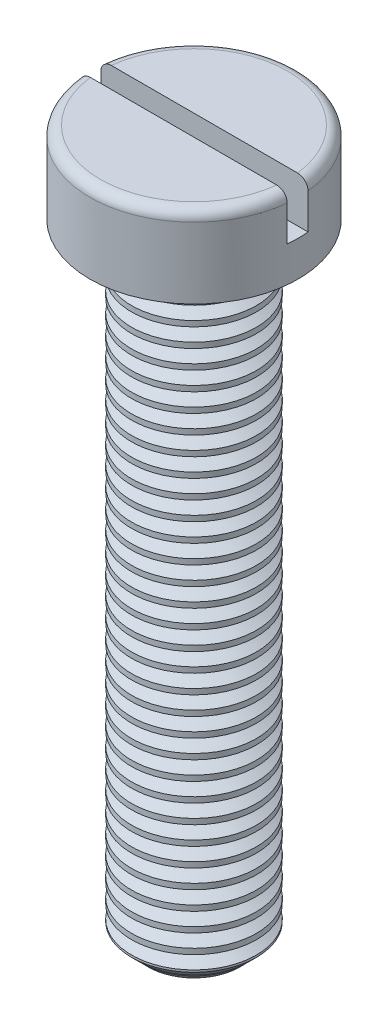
ISO-10303-21;
HEADER;
FILE_DESCRIPTION(('STEP AP214'),'2;1');
FILE_NAME('part.step','',(''),(''),'','','');
FILE_SCHEMA(('AUTOMOTIVE_DESIGN { 1 0 10303 214 1 1 1 1 }'));
ENDSEC;
DATA;
#1=APPLICATION_CONTEXT('core data for automotive mechanical design processes');
#2=APPLICATION_PROTOCOL_DEFINITION('international standard','automotive_design',2000,#1);
#3=PRODUCT_CONTEXT('',#1,'mechanical');
#4=PRODUCT('Part','Part','',(#3));
#5=PRODUCT_RELATED_PRODUCT_CATEGORY('part','',(#4));
#6=PRODUCT_DEFINITION_FORMATION('','',#4);
#7=PRODUCT_DEFINITION_CONTEXT('part definition',#1,'design');
#8=PRODUCT_DEFINITION('design','',#6,#7);
#9=PRODUCT_DEFINITION_SHAPE('','',#8);
#10=(LENGTH_UNIT() NAMED_UNIT(*) SI_UNIT(.MILLI.,.METRE.));
#11=(NAMED_UNIT(*) PLANE_ANGLE_UNIT() SI_UNIT($,.RADIAN.));
#12=(NAMED_UNIT(*) SI_UNIT($,.STERADIAN.) SOLID_ANGLE_UNIT());
#13=UNCERTAINTY_MEASURE_WITH_UNIT(LENGTH_MEASURE(1.E-05),#10,'distance_accuracy_value','');
#14=(GEOMETRIC_REPRESENTATION_CONTEXT(3) GLOBAL_UNCERTAINTY_ASSIGNED_CONTEXT((#13)) GLOBAL_UNIT_ASSIGNED_CONTEXT((#10,
#11,#12)) REPRESENTATION_CONTEXT('',''));
#15=CARTESIAN_POINT('',(0.,0.,0.));
#16=DIRECTION('',(0.,0.,1.));
#17=DIRECTION('',(1.,0.,0.));
#18=AXIS2_PLACEMENT_3D('',#15,#16,#17);
#19=CARTESIAN_POINT('',(5.,33.9,0.));
#20=DIRECTION('',(0.,1.,0.));
#21=DIRECTION('',(0.,0.,1.));
#22=AXIS2_PLACEMENT_3D('',#19,#20,#21);
#23=PLANE('',#22);
#24=CARTESIAN_POINT('',(0.,33.9,0.));
#25=DIRECTION('',(0.,1.,0.));
#26=DIRECTION('',(0.,0.,1.));
#27=AXIS2_PLACEMENT_3D('',#24,#25,#26);
#28=CIRCLE('',#27,4.5);
#29=CARTESIAN_POINT('',(4.47213595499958,33.9,-0.5));
#30=VERTEX_POINT('',#29);
#31=CARTESIAN_POINT('',(-4.47213595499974,33.9,-0.5));
#32=VERTEX_POINT('',#31);
#33=EDGE_CURVE('E87',#30,#32,#28,.T.);
#34=ORIENTED_EDGE('',*,*,#33,.T.);
#35=DIRECTION('',(-1.,0.,0.));
#36=VECTOR('',#35,1.);
#37=CARTESIAN_POINT('',(4.5,33.9,-0.5));
#38=LINE('',#37,#36);
#39=EDGE_CURVE('E119',#30,#32,#38,.T.);
#40=ORIENTED_EDGE('',*,*,#39,.F.);
#41=EDGE_LOOP('',(#34,#40));
#42=FACE_BOUND('',#41,.T.);
#43=ADVANCED_FACE('F17',(#42),#23,.T.);
#44=CARTESIAN_POINT('',(0.,33.4,0.));
#45=DIRECTION('',(0.,1.,0.));
#46=DIRECTION('',(0.,0.,1.));
#47=AXIS2_PLACEMENT_3D('',#44,#45,#46);
#48=TOROIDAL_SURFACE('',#47,4.5,0.5);
#49=CARTESIAN_POINT('',(0.,33.4,0.));
#50=DIRECTION('',(0.,1.,0.));
#51=DIRECTION('',(0.,0.,1.));
#52=AXIS2_PLACEMENT_3D('',#49,#50,#51);
#53=CIRCLE('',#52,5.);
#54=CARTESIAN_POINT('',(-4.9749371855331,33.4,-0.5));
#55=VERTEX_POINT('',#54);
#56=CARTESIAN_POINT('',(4.9749371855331,33.4,-0.5));
#57=VERTEX_POINT('',#56);
#58=EDGE_CURVE('E88',#55,#57,#53,.F.);
#59=ORIENTED_EDGE('',*,*,#58,.F.);
#60=CARTESIAN_POINT('',(-4.94832297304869,33.5605580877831,-0.5));
#61=CARTESIAN_POINT('',(-4.93926669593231,33.5871276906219,-0.5));
#62=CARTESIAN_POINT('',(-4.92795280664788,33.6129498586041,-0.5));
#63=CARTESIAN_POINT('',(-4.90113483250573,33.6623458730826,-0.5));
#64=CARTESIAN_POINT('',(-4.88562557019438,33.6859168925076,-0.5));
#65=CARTESIAN_POINT('',(-4.85088198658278,33.7301089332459,-0.5));
#66=CARTESIAN_POINT('',(-4.83165017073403,33.7507319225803,-0.5));
#67=CARTESIAN_POINT('',(-4.79001360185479,33.7884641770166,-0.5));
#68=CARTESIAN_POINT('',(-4.76760962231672,33.8055742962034,-0.5));
#69=CARTESIAN_POINT('',(-4.72017589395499,33.8358729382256,-0.5));
#70=CARTESIAN_POINT('',(-4.69513691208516,33.8490470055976,-0.5));
#71=CARTESIAN_POINT('',(-4.64321002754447,33.8710302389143,-0.5));
#72=CARTESIAN_POINT('',(-4.6163219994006,33.8798391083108,-0.5));
#73=CARTESIAN_POINT('',(-4.56130940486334,33.8928883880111,-0.5));
#74=CARTESIAN_POINT('',(-4.53317906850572,33.8971044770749,-0.5));
#75=CARTESIAN_POINT('',(-4.47660936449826,33.9007733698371,-0.5));
#76=CARTESIAN_POINT('',(-4.44816998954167,33.9002260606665,-0.5));
#77=CARTESIAN_POINT('',(-4.39167722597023,33.8943752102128,-0.5));
#78=CARTESIAN_POINT('',(-4.36362566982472,33.8890539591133,-0.5));
#79=CARTESIAN_POINT('',(-4.30881313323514,33.8737789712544,-0.5));
#80=CARTESIAN_POINT('',(-4.28205216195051,33.8638252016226,-0.5));
#81=CARTESIAN_POINT('',(-4.23057845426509,33.8395579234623,-0.5));
#82=CARTESIAN_POINT('',(-4.20586614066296,33.825243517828,-0.5));
#83=CARTESIAN_POINT('',(-4.15920813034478,33.7926529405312,-0.5));
#84=CARTESIAN_POINT('',(-4.13726239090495,33.7743768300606,-0.5));
#85=CARTESIAN_POINT('',(-4.09686174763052,33.7344572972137,-0.5));
#86=CARTESIAN_POINT('',(-4.07839287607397,33.7128280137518,-0.5));
#87=CARTESIAN_POINT('',(-4.04537912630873,33.6667572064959,-0.5));
#88=CARTESIAN_POINT('',(-4.03083409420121,33.6423157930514,-0.5));
#89=CARTESIAN_POINT('',(-4.00619006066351,33.5914977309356,-0.5));
#90=CARTESIAN_POINT('',(-3.9960605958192,33.5651358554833,-0.5));
#91=CARTESIAN_POINT('',(-3.98040355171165,33.511079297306,-0.5));
#92=CARTESIAN_POINT('',(-3.97487578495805,33.4833846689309,-0.5));
#93=CARTESIAN_POINT('',(-3.96860916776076,33.4276386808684,-0.5));
#94=CARTESIAN_POINT('',(-3.96783992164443,33.399590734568,-0.5));
#95=CARTESIAN_POINT('',(-3.97103223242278,33.3437657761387,-0.5));
#96=CARTESIAN_POINT('',(-3.97499370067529,33.315988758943,-0.5));
#97=CARTESIAN_POINT('',(-3.98751543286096,33.2615531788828,-0.5));
#98=CARTESIAN_POINT('',(-3.99606609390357,33.2348924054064,-0.5));
#99=CARTESIAN_POINT('',(-4.01750694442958,33.1833775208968,-0.5));
#100=CARTESIAN_POINT('',(-4.0303971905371,33.1585234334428,-0.5));
#101=CARTESIAN_POINT('',(-4.060192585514,33.1112312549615,-0.5));
#102=CARTESIAN_POINT('',(-4.07711147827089,33.0888018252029,-0.5));
#103=CARTESIAN_POINT('',(-4.114450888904,33.0470769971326,-0.5));
#104=CARTESIAN_POINT('',(-4.13487152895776,33.0277817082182,-0.5));
#105=CARTESIAN_POINT('',(-4.17878516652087,32.9927303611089,-0.5));
#106=CARTESIAN_POINT('',(-4.20229841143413,32.976999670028,-0.5));
#107=CARTESIAN_POINT('',(-4.25161853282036,32.9496788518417,-0.5));
#108=CARTESIAN_POINT('',(-4.27742549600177,32.9380888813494,-0.5));
#109=CARTESIAN_POINT('',(-4.33078254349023,32.9193034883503,-0.5));
#110=CARTESIAN_POINT('',(-4.35834292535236,32.9121373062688,-0.5));
#111=CARTESIAN_POINT('',(-4.41427439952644,32.9025173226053,-0.5));
#112=CARTESIAN_POINT('',(-4.44264550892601,32.900063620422,-0.5));
#113=CARTESIAN_POINT('',(-4.49948772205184,32.899938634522,-0.5));
#114=CARTESIAN_POINT('',(-4.52795886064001,32.9022823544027,-0.5));
#115=CARTESIAN_POINT('',(-4.58410262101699,32.9117217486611,-0.5));
#116=CARTESIAN_POINT('',(-4.61177524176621,32.9188174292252,-0.5));
#117=CARTESIAN_POINT('',(-4.66550006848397,32.9375570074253,-0.5));
#118=CARTESIAN_POINT('',(-4.6915540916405,32.9491956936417,-0.5));
#119=CARTESIAN_POINT('',(-4.74132663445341,32.9767002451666,-0.5));
#120=CARTESIAN_POINT('',(-4.76504519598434,32.9925660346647,-0.5));
#121=CARTESIAN_POINT('',(-4.80936329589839,33.02800400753,-0.5));
#122=CARTESIAN_POINT('',(-4.82997572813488,33.0475600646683,-0.5));
#123=CARTESIAN_POINT('',(-4.86760225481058,33.0898709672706,-0.5));
#124=CARTESIAN_POINT('',(-4.88461659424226,33.1126255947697,-0.5));
#125=CARTESIAN_POINT('',(-4.91446725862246,33.1605543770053,-0.5));
#126=CARTESIAN_POINT('',(-4.92732591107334,33.1857146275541,-0.5));
#127=CARTESIAN_POINT('',(-4.94861828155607,33.2378506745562,-0.5));
#128=CARTESIAN_POINT('',(-4.95705100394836,33.2648268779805,-0.5));
#129=CARTESIAN_POINT('',(-4.96921571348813,33.3197053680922,-0.5));
#130=CARTESIAN_POINT('',(-4.97296596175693,33.3476036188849,-0.5));
#131=CARTESIAN_POINT('',(-4.97571162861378,33.4036096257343,-0.5));
#132=CARTESIAN_POINT('',(-4.97471289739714,33.4317170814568,-0.5));
#133=CARTESIAN_POINT('',(-4.9692940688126,33.4767046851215,-0.5));
#134=CARTESIAN_POINT('',(-4.96632638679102,33.4937728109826,-0.5));
#135=CARTESIAN_POINT('',(-4.95863290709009,33.5275080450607,-0.5));
#136=CARTESIAN_POINT('',(-4.95390711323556,33.54417515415,-0.5));
#137=CARTESIAN_POINT('',(-4.94832297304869,33.5605580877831,-0.5));
#138=B_SPLINE_CURVE_WITH_KNOTS('',3,(#60,#61,#62,#63,#64,#65,#66,#67,#68,#69,#70,#71,#72,#73,
#74,#75,#76,#77,#78,#79,#80,#81,#82,#83,#84,#85,#86,#87,#88,#89,#90,#91,#92,#93,#94,#95,#96,#97,
#98,#99,#100,#101,#102,#103,#104,#105,#106,#107,#108,#109,#110,#111,#112,#113,#114,#115,#116,
#117,#118,#119,#120,#121,#122,#123,#124,#125,#126,#127,#128,#129,#130,#131,#132,#133,#134,#135,
#136,#137),.UNSPECIFIED.,.T.,.F.,(4,2,2,2,2,2,2,2,2,2,2,2,2,2,2,2,2,2,2,2,2,2,2,2,2,2,2,2,2,2,2,
2,2,2,2,2,2,2,4),(0.,0.0841483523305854,0.16840102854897,0.252597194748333,0.336772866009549,
0.421253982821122,0.505740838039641,0.5906729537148,0.675607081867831,0.760857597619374,
0.846108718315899,0.931377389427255,1.01664474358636,1.10156187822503,1.1864756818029,
1.27079400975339,1.355108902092,1.43888466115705,1.52265885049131,1.60625842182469,
1.68985908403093,1.7737491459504,1.85764213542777,1.94211459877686,2.02659025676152,
2.11161846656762,2.19664846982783,2.28194480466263,2.36724125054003,2.45244013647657,
2.53763749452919,2.62247082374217,2.70729837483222,2.79166228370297,2.87604516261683,
2.96009791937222,3.04404715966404,3.09593351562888,3.14781975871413),.UNSPECIFIED.);
#139=EDGE_CURVE('E41',#55,#32,#138,.T.);
#140=ORIENTED_EDGE('',*,*,#139,.T.);
#141=ORIENTED_EDGE('',*,*,#33,.F.);
#142=CARTESIAN_POINT('',(3.98059649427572,33.5083276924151,-0.5));
#143=CARTESIAN_POINT('',(3.98671474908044,33.535675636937,-0.5));
#144=CARTESIAN_POINT('',(3.99515766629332,33.5625249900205,-0.5));
#145=CARTESIAN_POINT('',(4.01644772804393,33.6144428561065,-0.5));
#146=CARTESIAN_POINT('',(4.02930037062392,33.6395090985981,-0.5));
#147=CARTESIAN_POINT('',(4.05901769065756,33.6871140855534,-0.5));
#148=CARTESIAN_POINT('',(4.07587932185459,33.7096547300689,-0.5));
#149=CARTESIAN_POINT('',(4.11312487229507,33.751596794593,-0.5));
#150=CARTESIAN_POINT('',(4.13350795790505,33.7709989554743,-0.5));
#151=CARTESIAN_POINT('',(4.17733073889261,33.8062322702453,-0.5));
#152=CARTESIAN_POINT('',(4.20078566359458,33.8220444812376,-0.5));
#153=CARTESIAN_POINT('',(4.25000440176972,33.8495376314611,-0.5));
#154=CARTESIAN_POINT('',(4.27576838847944,33.8612182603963,-0.5));
#155=CARTESIAN_POINT('',(4.32905519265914,33.880191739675,-0.5));
#156=CARTESIAN_POINT('',(4.35658842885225,33.8874553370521,-0.5));
#157=CARTESIAN_POINT('',(4.41248226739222,33.8972735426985,-0.5));
#158=CARTESIAN_POINT('',(4.44084288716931,33.8998280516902,-0.5));
#159=CARTESIAN_POINT('',(4.49768248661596,33.9001556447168,-0.5));
#160=CARTESIAN_POINT('',(4.52616155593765,33.8979135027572,-0.5));
#161=CARTESIAN_POINT('',(4.58233807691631,33.8886747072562,-0.5));
#162=CARTESIAN_POINT('',(4.61003553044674,33.8816780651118,-0.5));
#163=CARTESIAN_POINT('',(4.66382762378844,33.8631307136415,-0.5));
#164=CARTESIAN_POINT('',(4.68992399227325,33.8515850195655,-0.5));
#165=CARTESIAN_POINT('',(4.73979635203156,33.8242580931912,-0.5));
#166=CARTESIAN_POINT('',(4.76357238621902,33.8084769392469,-0.5));
#167=CARTESIAN_POINT('',(4.80801881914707,33.7731969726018,-0.5));
#168=CARTESIAN_POINT('',(4.82870204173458,33.7537143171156,-0.5));
#169=CARTESIAN_POINT('',(4.86648235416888,33.7115364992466,-0.5));
#170=CARTESIAN_POINT('',(4.88357954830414,33.688841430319,-0.5));
#171=CARTESIAN_POINT('',(4.91360574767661,33.6410137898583,-0.5));
#172=CARTESIAN_POINT('',(4.92655660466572,33.6158949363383,-0.5));
#173=CARTESIAN_POINT('',(4.9480359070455,33.5638326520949,-0.5));
#174=CARTESIAN_POINT('',(4.95656446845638,33.5368892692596,-0.5));
#175=CARTESIAN_POINT('',(4.96892121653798,33.4820706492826,-0.5));
#176=CARTESIAN_POINT('',(4.97276997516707,33.4542000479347,-0.5));
#177=CARTESIAN_POINT('',(4.97572318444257,33.3982087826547,-0.5));
#178=CARTESIAN_POINT('',(4.9748277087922,33.3700881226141,-0.5));
#179=CARTESIAN_POINT('',(4.96832549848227,33.3144554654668,-0.5));
#180=CARTESIAN_POINT('',(4.96272838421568,33.2869423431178,-0.5));
#181=CARTESIAN_POINT('',(4.94699857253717,33.2332450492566,-0.5));
#182=CARTESIAN_POINT('',(4.9368658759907,33.2070608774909,-0.5));
#183=CARTESIAN_POINT('',(4.91234732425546,33.15673659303,-0.5));
#184=CARTESIAN_POINT('',(4.89795757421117,33.1325983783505,-0.5));
#185=CARTESIAN_POINT('',(4.86534353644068,33.0870691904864,-0.5));
#186=CARTESIAN_POINT('',(4.84711919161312,33.0656782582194,-0.5));
#187=CARTESIAN_POINT('',(4.80728554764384,33.0261661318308,-0.5));
#188=CARTESIAN_POINT('',(4.78566430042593,33.008056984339,-0.5));
#189=CARTESIAN_POINT('',(4.73970167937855,32.9757034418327,-0.5));
#190=CARTESIAN_POINT('',(4.71536023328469,32.9614591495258,-0.5));
#191=CARTESIAN_POINT('',(4.66451360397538,32.9371607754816,-0.5));
#192=CARTESIAN_POINT('',(4.6379978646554,32.9271287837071,-0.5));
#193=CARTESIAN_POINT('',(4.58366342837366,32.9116340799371,-0.5));
#194=CARTESIAN_POINT('',(4.55584469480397,32.9061714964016,-0.5));
#195=CARTESIAN_POINT('',(4.4995461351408,32.8999456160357,-0.5));
#196=CARTESIAN_POINT('',(4.47106371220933,32.8992057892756,-0.5));
#197=CARTESIAN_POINT('',(4.41437664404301,32.9025047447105,-0.5));
#198=CARTESIAN_POINT('',(4.3861720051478,32.9065436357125,-0.5));
#199=CARTESIAN_POINT('',(4.33076401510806,32.9193039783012,-0.5));
#200=CARTESIAN_POINT('',(4.3035634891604,32.9280377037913,-0.5));
#201=CARTESIAN_POINT('',(4.25101723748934,32.9499536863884,-0.5));
#202=CARTESIAN_POINT('',(4.22567151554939,32.9631359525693,-0.5));
#203=CARTESIAN_POINT('',(4.17759606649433,32.9935626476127,-0.5));
#204=CARTESIAN_POINT('',(4.15486283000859,33.0108015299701,-0.5));
#205=CARTESIAN_POINT('',(4.11263390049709,33.0488697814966,-0.5));
#206=CARTESIAN_POINT('',(4.0931379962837,33.0696989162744,-0.5));
#207=CARTESIAN_POINT('',(4.05805560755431,33.1142353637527,-0.5));
#208=CARTESIAN_POINT('',(4.0424479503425,33.1379259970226,-0.5));
#209=CARTESIAN_POINT('',(4.01546165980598,33.1876132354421,-0.5));
#210=CARTESIAN_POINT('',(4.00408391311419,33.2136103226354,-0.5));
#211=CARTESIAN_POINT('',(3.98596680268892,33.2669736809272,-0.5));
#212=CARTESIAN_POINT('',(3.9791965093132,33.2943294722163,-0.5));
#213=CARTESIAN_POINT('',(3.97038143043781,33.3497683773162,-0.5));
#214=CARTESIAN_POINT('',(3.9683307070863,33.3778505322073,-0.5));
#215=CARTESIAN_POINT('',(3.96886532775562,33.4231079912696,-0.5));
#216=CARTESIAN_POINT('',(3.96996807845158,33.4403140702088,-0.5));
#217=CARTESIAN_POINT('',(3.97395327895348,33.4745187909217,-0.5));
#218=CARTESIAN_POINT('',(3.97683572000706,33.4915174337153,-0.5));
#219=CARTESIAN_POINT('',(3.98059649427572,33.5083276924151,-0.5));
#220=B_SPLINE_CURVE_WITH_KNOTS('',3,(#142,#143,#144,#145,#146,#147,#148,#149,#150,#151,#152,
#153,#154,#155,#156,#157,#158,#159,#160,#161,#162,#163,#164,#165,#166,#167,#168,#169,#170,#171,
#172,#173,#174,#175,#176,#177,#178,#179,#180,#181,#182,#183,#184,#185,#186,#187,#188,#189,#190,
#191,#192,#193,#194,#195,#196,#197,#198,#199,#200,#201,#202,#203,#204,#205,#206,#207,#208,#209,
#210,#211,#212,#213,#214,#215,#216,#217,#218,#219),.UNSPECIFIED.,.T.,.F.,(4,2,2,2,2,2,2,2,2,2,2,
2,2,2,2,2,2,2,2,2,2,2,2,2,2,2,2,2,2,2,2,2,2,2,2,2,2,2,4),(0.,0.0840085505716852,
0.168122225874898,0.252172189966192,0.336202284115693,0.420665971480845,0.505136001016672,
0.590159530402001,0.675184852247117,0.760480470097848,0.845775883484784,0.930977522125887,
1.01617758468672,1.10101395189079,1.18584785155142,1.27022701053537,1.35460395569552,
1.43860863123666,1.52261200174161,1.6064439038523,1.6902757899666,1.77418461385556,
1.85809468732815,1.94230679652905,2.02652114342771,2.11117176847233,2.19582477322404,
2.280898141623,2.36597344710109,2.45127225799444,2.53657124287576,2.62175427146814,
2.70693174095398,2.79163472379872,2.87635545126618,2.96050168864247,3.04454200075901,
3.09618070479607,3.14781915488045),.UNSPECIFIED.);
#221=EDGE_CURVE('E430',#30,#57,#220,.T.);
#222=ORIENTED_EDGE('',*,*,#221,.T.);
#223=EDGE_LOOP('',(#59,#140,#141,#222));
#224=FACE_BOUND('',#223,.T.);
#225=ADVANCED_FACE('F451',(#224),#48,.T.);
#226=CARTESIAN_POINT('',(0.,0.,0.));
#227=DIRECTION('',(0.,-1.,0.));
#228=DIRECTION('',(0.,0.,-1.));
#229=AXIS2_PLACEMENT_3D('',#226,#227,#228);
#230=CYLINDRICAL_SURFACE('',#229,5.);
#231=DIRECTION('',(0.,-1.,0.));
#232=VECTOR('',#231,1.);
#233=CARTESIAN_POINT('',(4.9749371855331,0.,-0.5));
#234=LINE('',#233,#232);
#235=CARTESIAN_POINT('',(4.9749371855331,31.7,-0.5));
#236=VERTEX_POINT('',#235);
#237=EDGE_CURVE('E11',#57,#236,#234,.T.);
#238=ORIENTED_EDGE('',*,*,#237,.T.);
#239=CARTESIAN_POINT('',(0.,31.7,0.));
#240=DIRECTION('',(0.,-1.,0.));
#241=DIRECTION('',(0.,0.,-1.));
#242=AXIS2_PLACEMENT_3D('',#239,#240,#241);
#243=CIRCLE('',#242,5.);
#244=CARTESIAN_POINT('',(4.9749371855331,31.7,0.5));
#245=VERTEX_POINT('',#244);
#246=EDGE_CURVE('E105',#245,#236,#243,.F.);
#247=ORIENTED_EDGE('',*,*,#246,.F.);
#248=DIRECTION('',(0.,-1.,0.));
#249=VECTOR('',#248,1.);
#250=CARTESIAN_POINT('',(4.9749371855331,0.,0.5));
#251=LINE('',#250,#249);
#252=CARTESIAN_POINT('',(4.9749371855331,33.4,0.5));
#253=VERTEX_POINT('',#252);
#254=EDGE_CURVE('E91',#253,#245,#251,.T.);
#255=ORIENTED_EDGE('',*,*,#254,.F.);
#256=CARTESIAN_POINT('',(-4.9749371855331,33.4,0.5));
#257=VERTEX_POINT('',#256);
#258=EDGE_CURVE('E83',#253,#257,#53,.F.);
#259=ORIENTED_EDGE('',*,*,#258,.T.);
#260=DIRECTION('',(0.,-1.,0.));
#261=VECTOR('',#260,1.);
#262=CARTESIAN_POINT('',(-4.9749371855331,0.,0.5));
#263=LINE('',#262,#261);
#264=CARTESIAN_POINT('',(-4.9749371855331,31.7,0.5));
#265=VERTEX_POINT('',#264);
#266=EDGE_CURVE('E107',#265,#257,#263,.F.);
#267=ORIENTED_EDGE('',*,*,#266,.F.);
#268=CARTESIAN_POINT('',(-4.9749371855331,31.7,-0.5));
#269=VERTEX_POINT('',#268);
#270=EDGE_CURVE('E108',#269,#265,#243,.F.);
#271=ORIENTED_EDGE('',*,*,#270,.F.);
#272=DIRECTION('',(0.,-1.,0.));
#273=VECTOR('',#272,1.);
#274=CARTESIAN_POINT('',(-4.9749371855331,0.,-0.5));
#275=LINE('',#274,#273);
#276=EDGE_CURVE('E26',#269,#55,#275,.F.);
#277=ORIENTED_EDGE('',*,*,#276,.T.);
#278=ORIENTED_EDGE('',*,*,#58,.T.);
#279=EDGE_LOOP('',(#238,#247,#255,#259,#267,#271,#277,#278));
#280=FACE_BOUND('',#279,.T.);
#281=CARTESIAN_POINT('',(0.,30.,0.));
#282=DIRECTION('',(0.,-1.,0.));
#283=DIRECTION('',(0.,0.,-1.));
#284=AXIS2_PLACEMENT_3D('',#281,#282,#283);
#285=CIRCLE('',#284,5.);
#286=CARTESIAN_POINT('',(0.,30.,-5.));
#287=VERTEX_POINT('',#286);
#288=EDGE_CURVE('E103',#287,#287,#285,.T.);
#289=ORIENTED_EDGE('',*,*,#288,.F.);
#290=EDGE_LOOP('',(#289));
#291=FACE_BOUND('',#290,.T.);
#292=ADVANCED_FACE('F121',(#280,#291),#230,.T.);
#293=CARTESIAN_POINT('',(0.,0.,0.));
#294=DIRECTION('',(0.,-1.,0.));
#295=DIRECTION('',(0.,0.,-1.));
#296=AXIS2_PLACEMENT_3D('',#293,#294,#295);
#297=CYLINDRICAL_SURFACE('',#296,3.);
#298=CARTESIAN_POINT('',(0.,28.5350852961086,0.));
#299=DIRECTION('',(0.,-1.,0.));
#300=DIRECTION('',(0.,0.,-1.));
#301=AXIS2_PLACEMENT_3D('',#298,#299,#300);
#302=CIRCLE('',#301,3.);
#303=CARTESIAN_POINT('',(0.,28.5350852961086,-3.));
#304=VERTEX_POINT('',#303);
#305=EDGE_CURVE('E414',#304,#304,#302,.T.);
#306=ORIENTED_EDGE('',*,*,#305,.F.);
#307=EDGE_LOOP('',(#306));
#308=FACE_BOUND('',#307,.T.);
#309=CARTESIAN_POINT('',(0.,28.8,0.));
#310=DIRECTION('',(0.,-1.,0.));
#311=DIRECTION('',(0.,0.,-1.));
#312=AXIS2_PLACEMENT_3D('',#309,#310,#311);
#313=CIRCLE('',#312,3.);
#314=CARTESIAN_POINT('',(0.,28.8,-3.));
#315=VERTEX_POINT('',#314);
#316=EDGE_CURVE('E420',#315,#315,#313,.T.);
#317=ORIENTED_EDGE('',*,*,#316,.T.);
#318=EDGE_LOOP('',(#317));
#319=FACE_BOUND('',#318,.T.);
#320=ADVANCED_FACE('F1000',(#308,#319),#297,.T.);
#321=CARTESIAN_POINT('',(0.,27.6350852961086,0.));
#322=DIRECTION('',(0.,-1.,0.));
#323=DIRECTION('',(0.,0.,-1.));
#324=AXIS2_PLACEMENT_3D('',#321,#322,#323);
#325=CIRCLE('',#324,3.);
#326=CARTESIAN_POINT('',(0.,27.6350852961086,-3.));
#327=VERTEX_POINT('',#326);
#328=EDGE_CURVE('E405',#327,#327,#325,.T.);
#329=ORIENTED_EDGE('',*,*,#328,.F.);
#330=EDGE_LOOP('',(#329));
#331=FACE_BOUND('',#330,.T.);
#332=CARTESIAN_POINT('',(0.,27.9,0.));
#333=DIRECTION('',(0.,-1.,0.));
#334=DIRECTION('',(0.,0.,-1.));
#335=AXIS2_PLACEMENT_3D('',#332,#333,#334);
#336=CIRCLE('',#335,3.);
#337=CARTESIAN_POINT('',(0.,27.9,-3.));
#338=VERTEX_POINT('',#337);
#339=EDGE_CURVE('E411',#338,#338,#336,.T.);
#340=ORIENTED_EDGE('',*,*,#339,.T.);
#341=EDGE_LOOP('',(#340));
#342=FACE_BOUND('',#341,.T.);
#343=ADVANCED_FACE('F993',(#331,#342),#297,.T.);
#344=CARTESIAN_POINT('',(0.,26.7350852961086,0.));
#345=DIRECTION('',(0.,-1.,0.));
#346=DIRECTION('',(0.,0.,-1.));
#347=AXIS2_PLACEMENT_3D('',#344,#345,#346);
#348=CIRCLE('',#347,3.);
#349=CARTESIAN_POINT('',(0.,26.7350852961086,-3.));
#350=VERTEX_POINT('',#349);
#351=EDGE_CURVE('E396',#350,#350,#348,.T.);
#352=ORIENTED_EDGE('',*,*,#351,.F.);
#353=EDGE_LOOP('',(#352));
#354=FACE_BOUND('',#353,.T.);
#355=CARTESIAN_POINT('',(0.,27.,0.));
#356=DIRECTION('',(0.,-1.,0.));
#357=DIRECTION('',(0.,0.,-1.));
#358=AXIS2_PLACEMENT_3D('',#355,#356,#357);
#359=CIRCLE('',#358,3.);
#360=CARTESIAN_POINT('',(0.,27.,-3.));
#361=VERTEX_POINT('',#360);
#362=EDGE_CURVE('E402',#361,#361,#359,.T.);
#363=ORIENTED_EDGE('',*,*,#362,.T.);
#364=EDGE_LOOP('',(#363));
#365=FACE_BOUND('',#364,.T.);
#366=ADVANCED_FACE('F986',(#354,#365),#297,.T.);
#367=CARTESIAN_POINT('',(0.,25.8350852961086,0.));
#368=DIRECTION('',(0.,-1.,0.));
#369=DIRECTION('',(0.,0.,-1.));
#370=AXIS2_PLACEMENT_3D('',#367,#368,#369);
#371=CIRCLE('',#370,3.);
#372=CARTESIAN_POINT('',(0.,25.8350852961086,-3.));
#373=VERTEX_POINT('',#372);
#374=EDGE_CURVE('E387',#373,#373,#371,.T.);
#375=ORIENTED_EDGE('',*,*,#374,.F.);
#376=EDGE_LOOP('',(#375));
#377=FACE_BOUND('',#376,.T.);
#378=CARTESIAN_POINT('',(0.,26.1,0.));
#379=DIRECTION('',(0.,-1.,0.));
#380=DIRECTION('',(0.,0.,-1.));
#381=AXIS2_PLACEMENT_3D('',#378,#379,#380);
#382=CIRCLE('',#381,3.);
#383=CARTESIAN_POINT('',(0.,26.1,-3.));
#384=VERTEX_POINT('',#383);
#385=EDGE_CURVE('E393',#384,#384,#382,.T.);
#386=ORIENTED_EDGE('',*,*,#385,.T.);
#387=EDGE_LOOP('',(#386));
#388=FACE_BOUND('',#387,.T.);
#389=ADVANCED_FACE('F979',(#377,#388),#297,.T.);
#390=CARTESIAN_POINT('',(0.,24.9350852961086,0.));
#391=DIRECTION('',(0.,-1.,0.));
#392=DIRECTION('',(0.,0.,-1.));
#393=AXIS2_PLACEMENT_3D('',#390,#391,#392);
#394=CIRCLE('',#393,3.);
#395=CARTESIAN_POINT('',(0.,24.9350852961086,-3.));
#396=VERTEX_POINT('',#395);
#397=EDGE_CURVE('E378',#396,#396,#394,.T.);
#398=ORIENTED_EDGE('',*,*,#397,.F.);
#399=EDGE_LOOP('',(#398));
#400=FACE_BOUND('',#399,.T.);
#401=CARTESIAN_POINT('',(0.,25.2,0.));
#402=DIRECTION('',(0.,-1.,0.));
#403=DIRECTION('',(0.,0.,-1.));
#404=AXIS2_PLACEMENT_3D('',#401,#402,#403);
#405=CIRCLE('',#404,3.);
#406=CARTESIAN_POINT('',(0.,25.2,-3.));
#407=VERTEX_POINT('',#406);
#408=EDGE_CURVE('E384',#407,#407,#405,.T.);
#409=ORIENTED_EDGE('',*,*,#408,.T.);
#410=EDGE_LOOP('',(#409));
#411=FACE_BOUND('',#410,.T.);
#412=ADVANCED_FACE('F972',(#400,#411),#297,.T.);
#413=CARTESIAN_POINT('',(0.,24.0350852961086,0.));
#414=DIRECTION('',(0.,-1.,0.));
#415=DIRECTION('',(0.,0.,-1.));
#416=AXIS2_PLACEMENT_3D('',#413,#414,#415);
#417=CIRCLE('',#416,3.);
#418=CARTESIAN_POINT('',(0.,24.0350852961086,-3.));
#419=VERTEX_POINT('',#418);
#420=EDGE_CURVE('E369',#419,#419,#417,.T.);
#421=ORIENTED_EDGE('',*,*,#420,.F.);
#422=EDGE_LOOP('',(#421));
#423=FACE_BOUND('',#422,.T.);
#424=CARTESIAN_POINT('',(0.,24.3,0.));
#425=DIRECTION('',(0.,-1.,0.));
#426=DIRECTION('',(0.,0.,-1.));
#427=AXIS2_PLACEMENT_3D('',#424,#425,#426);
#428=CIRCLE('',#427,3.);
#429=CARTESIAN_POINT('',(0.,24.3,-3.));
#430=VERTEX_POINT('',#429);
#431=EDGE_CURVE('E375',#430,#430,#428,.T.);
#432=ORIENTED_EDGE('',*,*,#431,.T.);
#433=EDGE_LOOP('',(#432));
#434=FACE_BOUND('',#433,.T.);
#435=ADVANCED_FACE('F965',(#423,#434),#297,.T.);
#436=CARTESIAN_POINT('',(0.,23.1350852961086,0.));
#437=DIRECTION('',(0.,-1.,0.));
#438=DIRECTION('',(0.,0.,-1.));
#439=AXIS2_PLACEMENT_3D('',#436,#437,#438);
#440=CIRCLE('',#439,3.);
#441=CARTESIAN_POINT('',(0.,23.1350852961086,-3.));
#442=VERTEX_POINT('',#441);
#443=EDGE_CURVE('E360',#442,#442,#440,.T.);
#444=ORIENTED_EDGE('',*,*,#443,.F.);
#445=EDGE_LOOP('',(#444));
#446=FACE_BOUND('',#445,.T.);
#447=CARTESIAN_POINT('',(0.,23.4,0.));
#448=DIRECTION('',(0.,-1.,0.));
#449=DIRECTION('',(0.,0.,-1.));
#450=AXIS2_PLACEMENT_3D('',#447,#448,#449);
#451=CIRCLE('',#450,3.);
#452=CARTESIAN_POINT('',(0.,23.4,-3.));
#453=VERTEX_POINT('',#452);
#454=EDGE_CURVE('E366',#453,#453,#451,.T.);
#455=ORIENTED_EDGE('',*,*,#454,.T.);
#456=EDGE_LOOP('',(#455));
#457=FACE_BOUND('',#456,.T.);
#458=ADVANCED_FACE('F958',(#446,#457),#297,.T.);
#459=CARTESIAN_POINT('',(0.,22.2350852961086,0.));
#460=DIRECTION('',(0.,-1.,0.));
#461=DIRECTION('',(0.,0.,-1.));
#462=AXIS2_PLACEMENT_3D('',#459,#460,#461);
#463=CIRCLE('',#462,3.);
#464=CARTESIAN_POINT('',(0.,22.2350852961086,-3.));
#465=VERTEX_POINT('',#464);
#466=EDGE_CURVE('E351',#465,#465,#463,.T.);
#467=ORIENTED_EDGE('',*,*,#466,.F.);
#468=EDGE_LOOP('',(#467));
#469=FACE_BOUND('',#468,.T.);
#470=CARTESIAN_POINT('',(0.,22.5,0.));
#471=DIRECTION('',(0.,-1.,0.));
#472=DIRECTION('',(0.,0.,-1.));
#473=AXIS2_PLACEMENT_3D('',#470,#471,#472);
#474=CIRCLE('',#473,3.);
#475=CARTESIAN_POINT('',(0.,22.5,-3.));
#476=VERTEX_POINT('',#475);
#477=EDGE_CURVE('E357',#476,#476,#474,.T.);
#478=ORIENTED_EDGE('',*,*,#477,.T.);
#479=EDGE_LOOP('',(#478));
#480=FACE_BOUND('',#479,.T.);
#481=ADVANCED_FACE('F951',(#469,#480),#297,.T.);
#482=CARTESIAN_POINT('',(0.,21.3350852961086,0.));
#483=DIRECTION('',(0.,-1.,0.));
#484=DIRECTION('',(0.,0.,-1.));
#485=AXIS2_PLACEMENT_3D('',#482,#483,#484);
#486=CIRCLE('',#485,3.);
#487=CARTESIAN_POINT('',(0.,21.3350852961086,-3.));
#488=VERTEX_POINT('',#487);
#489=EDGE_CURVE('E342',#488,#488,#486,.T.);
#490=ORIENTED_EDGE('',*,*,#489,.F.);
#491=EDGE_LOOP('',(#490));
#492=FACE_BOUND('',#491,.T.);
#493=CARTESIAN_POINT('',(0.,21.6,0.));
#494=DIRECTION('',(0.,-1.,0.));
#495=DIRECTION('',(0.,0.,-1.));
#496=AXIS2_PLACEMENT_3D('',#493,#494,#495);
#497=CIRCLE('',#496,3.);
#498=CARTESIAN_POINT('',(0.,21.6,-3.));
#499=VERTEX_POINT('',#498);
#500=EDGE_CURVE('E348',#499,#499,#497,.T.);
#501=ORIENTED_EDGE('',*,*,#500,.T.);
#502=EDGE_LOOP('',(#501));
#503=FACE_BOUND('',#502,.T.);
#504=ADVANCED_FACE('F944',(#492,#503),#297,.T.);
#505=CARTESIAN_POINT('',(0.,20.4350852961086,0.));
#506=DIRECTION('',(0.,-1.,0.));
#507=DIRECTION('',(0.,0.,-1.));
#508=AXIS2_PLACEMENT_3D('',#505,#506,#507);
#509=CIRCLE('',#508,3.);
#510=CARTESIAN_POINT('',(0.,20.4350852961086,-3.));
#511=VERTEX_POINT('',#510);
#512=EDGE_CURVE('E333',#511,#511,#509,.T.);
#513=ORIENTED_EDGE('',*,*,#512,.F.);
#514=EDGE_LOOP('',(#513));
#515=FACE_BOUND('',#514,.T.);
#516=CARTESIAN_POINT('',(0.,20.7,0.));
#517=DIRECTION('',(0.,-1.,0.));
#518=DIRECTION('',(0.,0.,-1.));
#519=AXIS2_PLACEMENT_3D('',#516,#517,#518);
#520=CIRCLE('',#519,3.);
#521=CARTESIAN_POINT('',(0.,20.7,-3.));
#522=VERTEX_POINT('',#521);
#523=EDGE_CURVE('E339',#522,#522,#520,.T.);
#524=ORIENTED_EDGE('',*,*,#523,.T.);
#525=EDGE_LOOP('',(#524));
#526=FACE_BOUND('',#525,.T.);
#527=ADVANCED_FACE('F937',(#515,#526),#297,.T.);
#528=CARTESIAN_POINT('',(0.,19.5350852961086,0.));
#529=DIRECTION('',(0.,-1.,0.));
#530=DIRECTION('',(0.,0.,-1.));
#531=AXIS2_PLACEMENT_3D('',#528,#529,#530);
#532=CIRCLE('',#531,3.);
#533=CARTESIAN_POINT('',(0.,19.5350852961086,-3.));
#534=VERTEX_POINT('',#533);
#535=EDGE_CURVE('E324',#534,#534,#532,.T.);
#536=ORIENTED_EDGE('',*,*,#535,.F.);
#537=EDGE_LOOP('',(#536));
#538=FACE_BOUND('',#537,.T.);
#539=CARTESIAN_POINT('',(0.,19.8,0.));
#540=DIRECTION('',(0.,-1.,0.));
#541=DIRECTION('',(0.,0.,-1.));
#542=AXIS2_PLACEMENT_3D('',#539,#540,#541);
#543=CIRCLE('',#542,3.);
#544=CARTESIAN_POINT('',(0.,19.8,-3.));
#545=VERTEX_POINT('',#544);
#546=EDGE_CURVE('E330',#545,#545,#543,.T.);
#547=ORIENTED_EDGE('',*,*,#546,.T.);
#548=EDGE_LOOP('',(#547));
#549=FACE_BOUND('',#548,.T.);
#550=ADVANCED_FACE('F930',(#538,#549),#297,.T.);
#551=CARTESIAN_POINT('',(0.,18.6350852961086,0.));
#552=DIRECTION('',(0.,-1.,0.));
#553=DIRECTION('',(0.,0.,-1.));
#554=AXIS2_PLACEMENT_3D('',#551,#552,#553);
#555=CIRCLE('',#554,3.);
#556=CARTESIAN_POINT('',(0.,18.6350852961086,-3.));
#557=VERTEX_POINT('',#556);
#558=EDGE_CURVE('E315',#557,#557,#555,.T.);
#559=ORIENTED_EDGE('',*,*,#558,.F.);
#560=EDGE_LOOP('',(#559));
#561=FACE_BOUND('',#560,.T.);
#562=CARTESIAN_POINT('',(0.,18.9,0.));
#563=DIRECTION('',(0.,-1.,0.));
#564=DIRECTION('',(0.,0.,-1.));
#565=AXIS2_PLACEMENT_3D('',#562,#563,#564);
#566=CIRCLE('',#565,3.);
#567=CARTESIAN_POINT('',(0.,18.9,-3.));
#568=VERTEX_POINT('',#567);
#569=EDGE_CURVE('E321',#568,#568,#566,.T.);
#570=ORIENTED_EDGE('',*,*,#569,.T.);
#571=EDGE_LOOP('',(#570));
#572=FACE_BOUND('',#571,.T.);
#573=ADVANCED_FACE('F923',(#561,#572),#297,.T.);
#574=CARTESIAN_POINT('',(0.,17.7350852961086,0.));
#575=DIRECTION('',(0.,-1.,0.));
#576=DIRECTION('',(0.,0.,-1.));
#577=AXIS2_PLACEMENT_3D('',#574,#575,#576);
#578=CIRCLE('',#577,3.);
#579=CARTESIAN_POINT('',(0.,17.7350852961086,-3.));
#580=VERTEX_POINT('',#579);
#581=EDGE_CURVE('E306',#580,#580,#578,.T.);
#582=ORIENTED_EDGE('',*,*,#581,.F.);
#583=EDGE_LOOP('',(#582));
#584=FACE_BOUND('',#583,.T.);
#585=CARTESIAN_POINT('',(0.,18.,0.));
#586=DIRECTION('',(0.,-1.,0.));
#587=DIRECTION('',(0.,0.,-1.));
#588=AXIS2_PLACEMENT_3D('',#585,#586,#587);
#589=CIRCLE('',#588,3.);
#590=CARTESIAN_POINT('',(0.,18.,-3.));
#591=VERTEX_POINT('',#590);
#592=EDGE_CURVE('E312',#591,#591,#589,.T.);
#593=ORIENTED_EDGE('',*,*,#592,.T.);
#594=EDGE_LOOP('',(#593));
#595=FACE_BOUND('',#594,.T.);
#596=ADVANCED_FACE('F916',(#584,#595),#297,.T.);
#597=CARTESIAN_POINT('',(0.,16.8350852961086,0.));
#598=DIRECTION('',(0.,-1.,0.));
#599=DIRECTION('',(0.,0.,-1.));
#600=AXIS2_PLACEMENT_3D('',#597,#598,#599);
#601=CIRCLE('',#600,3.);
#602=CARTESIAN_POINT('',(0.,16.8350852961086,-3.));
#603=VERTEX_POINT('',#602);
#604=EDGE_CURVE('E297',#603,#603,#601,.T.);
#605=ORIENTED_EDGE('',*,*,#604,.F.);
#606=EDGE_LOOP('',(#605));
#607=FACE_BOUND('',#606,.T.);
#608=CARTESIAN_POINT('',(0.,17.1,0.));
#609=DIRECTION('',(0.,-1.,0.));
#610=DIRECTION('',(0.,0.,-1.));
#611=AXIS2_PLACEMENT_3D('',#608,#609,#610);
#612=CIRCLE('',#611,3.);
#613=CARTESIAN_POINT('',(0.,17.1,-3.));
#614=VERTEX_POINT('',#613);
#615=EDGE_CURVE('E303',#614,#614,#612,.T.);
#616=ORIENTED_EDGE('',*,*,#615,.T.);
#617=EDGE_LOOP('',(#616));
#618=FACE_BOUND('',#617,.T.);
#619=ADVANCED_FACE('F909',(#607,#618),#297,.T.);
#620=CARTESIAN_POINT('',(0.,15.9350852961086,0.));
#621=DIRECTION('',(0.,-1.,0.));
#622=DIRECTION('',(0.,0.,-1.));
#623=AXIS2_PLACEMENT_3D('',#620,#621,#622);
#624=CIRCLE('',#623,3.);
#625=CARTESIAN_POINT('',(0.,15.9350852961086,-3.));
#626=VERTEX_POINT('',#625);
#627=EDGE_CURVE('E288',#626,#626,#624,.T.);
#628=ORIENTED_EDGE('',*,*,#627,.F.);
#629=EDGE_LOOP('',(#628));
#630=FACE_BOUND('',#629,.T.);
#631=CARTESIAN_POINT('',(0.,16.2,0.));
#632=DIRECTION('',(0.,-1.,0.));
#633=DIRECTION('',(0.,0.,-1.));
#634=AXIS2_PLACEMENT_3D('',#631,#632,#633);
#635=CIRCLE('',#634,3.);
#636=CARTESIAN_POINT('',(0.,16.2,-3.));
#637=VERTEX_POINT('',#636);
#638=EDGE_CURVE('E294',#637,#637,#635,.T.);
#639=ORIENTED_EDGE('',*,*,#638,.T.);
#640=EDGE_LOOP('',(#639));
#641=FACE_BOUND('',#640,.T.);
#642=ADVANCED_FACE('F902',(#630,#641),#297,.T.);
#643=CARTESIAN_POINT('',(0.,15.0350852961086,0.));
#644=DIRECTION('',(0.,-1.,0.));
#645=DIRECTION('',(0.,0.,-1.));
#646=AXIS2_PLACEMENT_3D('',#643,#644,#645);
#647=CIRCLE('',#646,3.);
#648=CARTESIAN_POINT('',(0.,15.0350852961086,-3.));
#649=VERTEX_POINT('',#648);
#650=EDGE_CURVE('E279',#649,#649,#647,.T.);
#651=ORIENTED_EDGE('',*,*,#650,.F.);
#652=EDGE_LOOP('',(#651));
#653=FACE_BOUND('',#652,.T.);
#654=CARTESIAN_POINT('',(0.,15.3,0.));
#655=DIRECTION('',(0.,-1.,0.));
#656=DIRECTION('',(0.,0.,-1.));
#657=AXIS2_PLACEMENT_3D('',#654,#655,#656);
#658=CIRCLE('',#657,3.);
#659=CARTESIAN_POINT('',(0.,15.3,-3.));
#660=VERTEX_POINT('',#659);
#661=EDGE_CURVE('E285',#660,#660,#658,.T.);
#662=ORIENTED_EDGE('',*,*,#661,.T.);
#663=EDGE_LOOP('',(#662));
#664=FACE_BOUND('',#663,.T.);
#665=ADVANCED_FACE('F895',(#653,#664),#297,.T.);
#666=CARTESIAN_POINT('',(0.,14.1350852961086,0.));
#667=DIRECTION('',(0.,-1.,0.));
#668=DIRECTION('',(0.,0.,-1.));
#669=AXIS2_PLACEMENT_3D('',#666,#667,#668);
#670=CIRCLE('',#669,3.);
#671=CARTESIAN_POINT('',(0.,14.1350852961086,-3.));
#672=VERTEX_POINT('',#671);
#673=EDGE_CURVE('E270',#672,#672,#670,.T.);
#674=ORIENTED_EDGE('',*,*,#673,.F.);
#675=EDGE_LOOP('',(#674));
#676=FACE_BOUND('',#675,.T.);
#677=CARTESIAN_POINT('',(0.,14.4,0.));
#678=DIRECTION('',(0.,-1.,0.));
#679=DIRECTION('',(0.,0.,-1.));
#680=AXIS2_PLACEMENT_3D('',#677,#678,#679);
#681=CIRCLE('',#680,3.);
#682=CARTESIAN_POINT('',(0.,14.4,-3.));
#683=VERTEX_POINT('',#682);
#684=EDGE_CURVE('E276',#683,#683,#681,.T.);
#685=ORIENTED_EDGE('',*,*,#684,.T.);
#686=EDGE_LOOP('',(#685));
#687=FACE_BOUND('',#686,.T.);
#688=ADVANCED_FACE('F888',(#676,#687),#297,.T.);
#689=CARTESIAN_POINT('',(0.,13.2350852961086,0.));
#690=DIRECTION('',(0.,-1.,0.));
#691=DIRECTION('',(0.,0.,-1.));
#692=AXIS2_PLACEMENT_3D('',#689,#690,#691);
#693=CIRCLE('',#692,3.);
#694=CARTESIAN_POINT('',(0.,13.2350852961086,-3.));
#695=VERTEX_POINT('',#694);
#696=EDGE_CURVE('E261',#695,#695,#693,.T.);
#697=ORIENTED_EDGE('',*,*,#696,.F.);
#698=EDGE_LOOP('',(#697));
#699=FACE_BOUND('',#698,.T.);
#700=CARTESIAN_POINT('',(0.,13.5,0.));
#701=DIRECTION('',(0.,-1.,0.));
#702=DIRECTION('',(0.,0.,-1.));
#703=AXIS2_PLACEMENT_3D('',#700,#701,#702);
#704=CIRCLE('',#703,3.);
#705=CARTESIAN_POINT('',(0.,13.5,-3.));
#706=VERTEX_POINT('',#705);
#707=EDGE_CURVE('E267',#706,#706,#704,.T.);
#708=ORIENTED_EDGE('',*,*,#707,.T.);
#709=EDGE_LOOP('',(#708));
#710=FACE_BOUND('',#709,.T.);
#711=ADVANCED_FACE('F881',(#699,#710),#297,.T.);
#712=CARTESIAN_POINT('',(0.,12.3350852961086,0.));
#713=DIRECTION('',(0.,-1.,0.));
#714=DIRECTION('',(0.,0.,-1.));
#715=AXIS2_PLACEMENT_3D('',#712,#713,#714);
#716=CIRCLE('',#715,3.);
#717=CARTESIAN_POINT('',(0.,12.3350852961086,-3.));
#718=VERTEX_POINT('',#717);
#719=EDGE_CURVE('E252',#718,#718,#716,.T.);
#720=ORIENTED_EDGE('',*,*,#719,.F.);
#721=EDGE_LOOP('',(#720));
#722=FACE_BOUND('',#721,.T.);
#723=CARTESIAN_POINT('',(0.,12.6,0.));
#724=DIRECTION('',(0.,-1.,0.));
#725=DIRECTION('',(0.,0.,-1.));
#726=AXIS2_PLACEMENT_3D('',#723,#724,#725);
#727=CIRCLE('',#726,3.);
#728=CARTESIAN_POINT('',(0.,12.6,-3.));
#729=VERTEX_POINT('',#728);
#730=EDGE_CURVE('E258',#729,#729,#727,.T.);
#731=ORIENTED_EDGE('',*,*,#730,.T.);
#732=EDGE_LOOP('',(#731));
#733=FACE_BOUND('',#732,.T.);
#734=ADVANCED_FACE('F874',(#722,#733),#297,.T.);
#735=CARTESIAN_POINT('',(0.,11.4350852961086,0.));
#736=DIRECTION('',(0.,-1.,0.));
#737=DIRECTION('',(0.,0.,-1.));
#738=AXIS2_PLACEMENT_3D('',#735,#736,#737);
#739=CIRCLE('',#738,3.);
#740=CARTESIAN_POINT('',(0.,11.4350852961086,-3.));
#741=VERTEX_POINT('',#740);
#742=EDGE_CURVE('E243',#741,#741,#739,.T.);
#743=ORIENTED_EDGE('',*,*,#742,.F.);
#744=EDGE_LOOP('',(#743));
#745=FACE_BOUND('',#744,.T.);
#746=CARTESIAN_POINT('',(0.,11.7,0.));
#747=DIRECTION('',(0.,-1.,0.));
#748=DIRECTION('',(0.,0.,-1.));
#749=AXIS2_PLACEMENT_3D('',#746,#747,#748);
#750=CIRCLE('',#749,3.);
#751=CARTESIAN_POINT('',(0.,11.7,-3.));
#752=VERTEX_POINT('',#751);
#753=EDGE_CURVE('E249',#752,#752,#750,.T.);
#754=ORIENTED_EDGE('',*,*,#753,.T.);
#755=EDGE_LOOP('',(#754));
#756=FACE_BOUND('',#755,.T.);
#757=ADVANCED_FACE('F867',(#745,#756),#297,.T.);
#758=CARTESIAN_POINT('',(0.,10.5350852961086,0.));
#759=DIRECTION('',(0.,-1.,0.));
#760=DIRECTION('',(0.,0.,-1.));
#761=AXIS2_PLACEMENT_3D('',#758,#759,#760);
#762=CIRCLE('',#761,3.);
#763=CARTESIAN_POINT('',(0.,10.5350852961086,-3.));
#764=VERTEX_POINT('',#763);
#765=EDGE_CURVE('E234',#764,#764,#762,.T.);
#766=ORIENTED_EDGE('',*,*,#765,.F.);
#767=EDGE_LOOP('',(#766));
#768=FACE_BOUND('',#767,.T.);
#769=CARTESIAN_POINT('',(0.,10.8,0.));
#770=DIRECTION('',(0.,-1.,0.));
#771=DIRECTION('',(0.,0.,-1.));
#772=AXIS2_PLACEMENT_3D('',#769,#770,#771);
#773=CIRCLE('',#772,3.);
#774=CARTESIAN_POINT('',(0.,10.8,-3.));
#775=VERTEX_POINT('',#774);
#776=EDGE_CURVE('E240',#775,#775,#773,.T.);
#777=ORIENTED_EDGE('',*,*,#776,.T.);
#778=EDGE_LOOP('',(#777));
#779=FACE_BOUND('',#778,.T.);
#780=ADVANCED_FACE('F860',(#768,#779),#297,.T.);
#781=CARTESIAN_POINT('',(0.,9.63508529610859,0.));
#782=DIRECTION('',(0.,-1.,0.));
#783=DIRECTION('',(0.,0.,-1.));
#784=AXIS2_PLACEMENT_3D('',#781,#782,#783);
#785=CIRCLE('',#784,3.);
#786=CARTESIAN_POINT('',(0.,9.63508529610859,-3.));
#787=VERTEX_POINT('',#786);
#788=EDGE_CURVE('E225',#787,#787,#785,.T.);
#789=ORIENTED_EDGE('',*,*,#788,.F.);
#790=EDGE_LOOP('',(#789));
#791=FACE_BOUND('',#790,.T.);
#792=CARTESIAN_POINT('',(0.,9.9,0.));
#793=DIRECTION('',(0.,-1.,0.));
#794=DIRECTION('',(0.,0.,-1.));
#795=AXIS2_PLACEMENT_3D('',#792,#793,#794);
#796=CIRCLE('',#795,3.);
#797=CARTESIAN_POINT('',(0.,9.9,-3.));
#798=VERTEX_POINT('',#797);
#799=EDGE_CURVE('E231',#798,#798,#796,.T.);
#800=ORIENTED_EDGE('',*,*,#799,.T.);
#801=EDGE_LOOP('',(#800));
#802=FACE_BOUND('',#801,.T.);
#803=ADVANCED_FACE('F853',(#791,#802),#297,.T.);
#804=CARTESIAN_POINT('',(0.,8.73508529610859,0.));
#805=DIRECTION('',(0.,-1.,0.));
#806=DIRECTION('',(0.,0.,-1.));
#807=AXIS2_PLACEMENT_3D('',#804,#805,#806);
#808=CIRCLE('',#807,3.);
#809=CARTESIAN_POINT('',(0.,8.73508529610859,-3.));
#810=VERTEX_POINT('',#809);
#811=EDGE_CURVE('E216',#810,#810,#808,.T.);
#812=ORIENTED_EDGE('',*,*,#811,.F.);
#813=EDGE_LOOP('',(#812));
#814=FACE_BOUND('',#813,.T.);
#815=CARTESIAN_POINT('',(0.,9.,0.));
#816=DIRECTION('',(0.,-1.,0.));
#817=DIRECTION('',(0.,0.,-1.));
#818=AXIS2_PLACEMENT_3D('',#815,#816,#817);
#819=CIRCLE('',#818,3.);
#820=CARTESIAN_POINT('',(0.,9.,-3.));
#821=VERTEX_POINT('',#820);
#822=EDGE_CURVE('E222',#821,#821,#819,.T.);
#823=ORIENTED_EDGE('',*,*,#822,.T.);
#824=EDGE_LOOP('',(#823));
#825=FACE_BOUND('',#824,.T.);
#826=ADVANCED_FACE('F846',(#814,#825),#297,.T.);
#827=CARTESIAN_POINT('',(0.,7.83508529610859,0.));
#828=DIRECTION('',(0.,-1.,0.));
#829=DIRECTION('',(0.,0.,-1.));
#830=AXIS2_PLACEMENT_3D('',#827,#828,#829);
#831=CIRCLE('',#830,3.);
#832=CARTESIAN_POINT('',(0.,7.83508529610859,-3.));
#833=VERTEX_POINT('',#832);
#834=EDGE_CURVE('E207',#833,#833,#831,.T.);
#835=ORIENTED_EDGE('',*,*,#834,.F.);
#836=EDGE_LOOP('',(#835));
#837=FACE_BOUND('',#836,.T.);
#838=CARTESIAN_POINT('',(0.,8.1,0.));
#839=DIRECTION('',(0.,-1.,0.));
#840=DIRECTION('',(0.,0.,-1.));
#841=AXIS2_PLACEMENT_3D('',#838,#839,#840);
#842=CIRCLE('',#841,3.);
#843=CARTESIAN_POINT('',(0.,8.1,-3.));
#844=VERTEX_POINT('',#843);
#845=EDGE_CURVE('E213',#844,#844,#842,.T.);
#846=ORIENTED_EDGE('',*,*,#845,.T.);
#847=EDGE_LOOP('',(#846));
#848=FACE_BOUND('',#847,.T.);
#849=ADVANCED_FACE('F839',(#837,#848),#297,.T.);
#850=CARTESIAN_POINT('',(0.,6.93508529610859,0.));
#851=DIRECTION('',(0.,-1.,0.));
#852=DIRECTION('',(0.,0.,-1.));
#853=AXIS2_PLACEMENT_3D('',#850,#851,#852);
#854=CIRCLE('',#853,3.);
#855=CARTESIAN_POINT('',(0.,6.93508529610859,-3.));
#856=VERTEX_POINT('',#855);
#857=EDGE_CURVE('E198',#856,#856,#854,.T.);
#858=ORIENTED_EDGE('',*,*,#857,.F.);
#859=EDGE_LOOP('',(#858));
#860=FACE_BOUND('',#859,.T.);
#861=CARTESIAN_POINT('',(0.,7.2,0.));
#862=DIRECTION('',(0.,-1.,0.));
#863=DIRECTION('',(0.,0.,-1.));
#864=AXIS2_PLACEMENT_3D('',#861,#862,#863);
#865=CIRCLE('',#864,3.);
#866=CARTESIAN_POINT('',(0.,7.2,-3.));
#867=VERTEX_POINT('',#866);
#868=EDGE_CURVE('E204',#867,#867,#865,.T.);
#869=ORIENTED_EDGE('',*,*,#868,.T.);
#870=EDGE_LOOP('',(#869));
#871=FACE_BOUND('',#870,.T.);
#872=ADVANCED_FACE('F832',(#860,#871),#297,.T.);
#873=CARTESIAN_POINT('',(0.,6.03508529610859,0.));
#874=DIRECTION('',(0.,-1.,0.));
#875=DIRECTION('',(0.,0.,-1.));
#876=AXIS2_PLACEMENT_3D('',#873,#874,#875);
#877=CIRCLE('',#876,3.);
#878=CARTESIAN_POINT('',(0.,6.03508529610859,-3.));
#879=VERTEX_POINT('',#878);
#880=EDGE_CURVE('E189',#879,#879,#877,.T.);
#881=ORIENTED_EDGE('',*,*,#880,.F.);
#882=EDGE_LOOP('',(#881));
#883=FACE_BOUND('',#882,.T.);
#884=CARTESIAN_POINT('',(0.,6.3,0.));
#885=DIRECTION('',(0.,-1.,0.));
#886=DIRECTION('',(0.,0.,-1.));
#887=AXIS2_PLACEMENT_3D('',#884,#885,#886);
#888=CIRCLE('',#887,3.);
#889=CARTESIAN_POINT('',(0.,6.3,-3.));
#890=VERTEX_POINT('',#889);
#891=EDGE_CURVE('E195',#890,#890,#888,.T.);
#892=ORIENTED_EDGE('',*,*,#891,.T.);
#893=EDGE_LOOP('',(#892));
#894=FACE_BOUND('',#893,.T.);
#895=ADVANCED_FACE('F825',(#883,#894),#297,.T.);
#896=CARTESIAN_POINT('',(0.,5.13508529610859,0.));
#897=DIRECTION('',(0.,-1.,0.));
#898=DIRECTION('',(0.,0.,-1.));
#899=AXIS2_PLACEMENT_3D('',#896,#897,#898);
#900=CIRCLE('',#899,3.);
#901=CARTESIAN_POINT('',(0.,5.13508529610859,-3.));
#902=VERTEX_POINT('',#901);
#903=EDGE_CURVE('E180',#902,#902,#900,.T.);
#904=ORIENTED_EDGE('',*,*,#903,.F.);
#905=EDGE_LOOP('',(#904));
#906=FACE_BOUND('',#905,.T.);
#907=CARTESIAN_POINT('',(0.,5.4,0.));
#908=DIRECTION('',(0.,-1.,0.));
#909=DIRECTION('',(0.,0.,-1.));
#910=AXIS2_PLACEMENT_3D('',#907,#908,#909);
#911=CIRCLE('',#910,3.);
#912=CARTESIAN_POINT('',(0.,5.4,-3.));
#913=VERTEX_POINT('',#912);
#914=EDGE_CURVE('E186',#913,#913,#911,.T.);
#915=ORIENTED_EDGE('',*,*,#914,.T.);
#916=EDGE_LOOP('',(#915));
#917=FACE_BOUND('',#916,.T.);
#918=ADVANCED_FACE('F818',(#906,#917),#297,.T.);
#919=CARTESIAN_POINT('',(0.,4.23508529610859,0.));
#920=DIRECTION('',(0.,-1.,0.));
#921=DIRECTION('',(0.,0.,-1.));
#922=AXIS2_PLACEMENT_3D('',#919,#920,#921);
#923=CIRCLE('',#922,3.);
#924=CARTESIAN_POINT('',(0.,4.23508529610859,-3.));
#925=VERTEX_POINT('',#924);
#926=EDGE_CURVE('E171',#925,#925,#923,.T.);
#927=ORIENTED_EDGE('',*,*,#926,.F.);
#928=EDGE_LOOP('',(#927));
#929=FACE_BOUND('',#928,.T.);
#930=CARTESIAN_POINT('',(0.,4.5,0.));
#931=DIRECTION('',(0.,-1.,0.));
#932=DIRECTION('',(0.,0.,-1.));
#933=AXIS2_PLACEMENT_3D('',#930,#931,#932);
#934=CIRCLE('',#933,3.);
#935=CARTESIAN_POINT('',(0.,4.5,-3.));
#936=VERTEX_POINT('',#935);
#937=EDGE_CURVE('E177',#936,#936,#934,.T.);
#938=ORIENTED_EDGE('',*,*,#937,.T.);
#939=EDGE_LOOP('',(#938));
#940=FACE_BOUND('',#939,.T.);
#941=ADVANCED_FACE('F811',(#929,#940),#297,.T.);
#942=CARTESIAN_POINT('',(0.,3.33508529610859,0.));
#943=DIRECTION('',(0.,-1.,0.));
#944=DIRECTION('',(0.,0.,-1.));
#945=AXIS2_PLACEMENT_3D('',#942,#943,#944);
#946=CIRCLE('',#945,3.);
#947=CARTESIAN_POINT('',(0.,3.33508529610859,-3.));
#948=VERTEX_POINT('',#947);
#949=EDGE_CURVE('E162',#948,#948,#946,.T.);
#950=ORIENTED_EDGE('',*,*,#949,.F.);
#951=EDGE_LOOP('',(#950));
#952=FACE_BOUND('',#951,.T.);
#953=CARTESIAN_POINT('',(0.,3.6,0.));
#954=DIRECTION('',(0.,-1.,0.));
#955=DIRECTION('',(0.,0.,-1.));
#956=AXIS2_PLACEMENT_3D('',#953,#954,#955);
#957=CIRCLE('',#956,3.);
#958=CARTESIAN_POINT('',(0.,3.6,-3.));
#959=VERTEX_POINT('',#958);
#960=EDGE_CURVE('E168',#959,#959,#957,.T.);
#961=ORIENTED_EDGE('',*,*,#960,.T.);
#962=EDGE_LOOP('',(#961));
#963=FACE_BOUND('',#962,.T.);
#964=ADVANCED_FACE('F804',(#952,#963),#297,.T.);
#965=CARTESIAN_POINT('',(0.,2.43508529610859,0.));
#966=DIRECTION('',(0.,-1.,0.));
#967=DIRECTION('',(0.,0.,-1.));
#968=AXIS2_PLACEMENT_3D('',#965,#966,#967);
#969=CIRCLE('',#968,3.);
#970=CARTESIAN_POINT('',(0.,2.43508529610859,-3.));
#971=VERTEX_POINT('',#970);
#972=EDGE_CURVE('E153',#971,#971,#969,.T.);
#973=ORIENTED_EDGE('',*,*,#972,.F.);
#974=EDGE_LOOP('',(#973));
#975=FACE_BOUND('',#974,.T.);
#976=CARTESIAN_POINT('',(0.,2.7,0.));
#977=DIRECTION('',(0.,-1.,0.));
#978=DIRECTION('',(0.,0.,-1.));
#979=AXIS2_PLACEMENT_3D('',#976,#977,#978);
#980=CIRCLE('',#979,3.);
#981=CARTESIAN_POINT('',(0.,2.7,-3.));
#982=VERTEX_POINT('',#981);
#983=EDGE_CURVE('E159',#982,#982,#980,.T.);
#984=ORIENTED_EDGE('',*,*,#983,.T.);
#985=EDGE_LOOP('',(#984));
#986=FACE_BOUND('',#985,.T.);
#987=ADVANCED_FACE('F797',(#975,#986),#297,.T.);
#988=CARTESIAN_POINT('',(0.,1.53508529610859,0.));
#989=DIRECTION('',(0.,-1.,0.));
#990=DIRECTION('',(0.,0.,-1.));
#991=AXIS2_PLACEMENT_3D('',#988,#989,#990);
#992=CIRCLE('',#991,3.);
#993=CARTESIAN_POINT('',(0.,1.53508529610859,-3.));
#994=VERTEX_POINT('',#993);
#995=EDGE_CURVE('E144',#994,#994,#992,.T.);
#996=ORIENTED_EDGE('',*,*,#995,.F.);
#997=EDGE_LOOP('',(#996));
#998=FACE_BOUND('',#997,.T.);
#999=CARTESIAN_POINT('',(0.,1.8,0.));
#1000=DIRECTION('',(0.,-1.,0.));
#1001=DIRECTION('',(0.,0.,-1.));
#1002=AXIS2_PLACEMENT_3D('',#999,#1000,#1001);
#1003=CIRCLE('',#1002,3.);
#1004=CARTESIAN_POINT('',(0.,1.8,-3.));
#1005=VERTEX_POINT('',#1004);
#1006=EDGE_CURVE('E150',#1005,#1005,#1003,.T.);
#1007=ORIENTED_EDGE('',*,*,#1006,.T.);
#1008=EDGE_LOOP('',(#1007));
#1009=FACE_BOUND('',#1008,.T.);
#1010=ADVANCED_FACE('F756',(#998,#1009),#297,.T.);
#1011=CARTESIAN_POINT('',(0.,0.8,0.));
#1012=DIRECTION('',(0.,-1.,0.));
#1013=DIRECTION('',(0.,0.,-1.));
#1014=AXIS2_PLACEMENT_3D('',#1011,#1012,#1013);
#1015=CIRCLE('',#1014,3.);
#1016=CARTESIAN_POINT('',(0.,0.8,-3.));
#1017=VERTEX_POINT('',#1016);
#1018=EDGE_CURVE('E125',#1017,#1017,#1015,.T.);
#1019=ORIENTED_EDGE('',*,*,#1018,.F.);
#1020=EDGE_LOOP('',(#1019));
#1021=FACE_BOUND('',#1020,.T.);
#1022=CARTESIAN_POINT('',(0.,0.9,0.));
#1023=DIRECTION('',(0.,-1.,0.));
#1024=DIRECTION('',(0.,0.,-1.));
#1025=AXIS2_PLACEMENT_3D('',#1022,#1023,#1024);
#1026=CIRCLE('',#1025,3.);
#1027=CARTESIAN_POINT('',(0.,0.9,-3.));
#1028=VERTEX_POINT('',#1027);
#1029=EDGE_CURVE('E141',#1028,#1028,#1026,.T.);
#1030=ORIENTED_EDGE('',*,*,#1029,.T.);
#1031=EDGE_LOOP('',(#1030));
#1032=FACE_BOUND('',#1031,.T.);
#1033=ADVANCED_FACE('F744',(#1021,#1032),#297,.T.);
#1034=CARTESIAN_POINT('',(0.,0.,0.));
#1035=DIRECTION('',(0.,1.,0.));
#1036=DIRECTION('',(0.,0.,1.));
#1037=AXIS2_PLACEMENT_3D('',#1034,#1035,#1036);
#1038=CONICAL_SURFACE('',#1037,2.2,0.785398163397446);
#1039=ORIENTED_EDGE('',*,*,#1018,.T.);
#1040=EDGE_LOOP('',(#1039));
#1041=FACE_BOUND('',#1040,.T.);
#1042=CARTESIAN_POINT('',(0.,0.409807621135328,0.));
#1043=DIRECTION('',(0.,1.,0.));
#1044=DIRECTION('',(0.,0.,1.));
#1045=AXIS2_PLACEMENT_3D('',#1042,#1043,#1044);
#1046=CIRCLE('',#1045,2.60980762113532);
#1047=CARTESIAN_POINT('',(0.,0.409807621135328,2.60980762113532));
#1048=VERTEX_POINT('',#1047);
#1049=EDGE_CURVE('E99',#1048,#1048,#1046,.T.);
#1050=ORIENTED_EDGE('',*,*,#1049,.T.);
#1051=EDGE_LOOP('',(#1050));
#1052=FACE_BOUND('',#1051,.T.);
#1053=ADVANCED_FACE('F738',(#1041,#1052),#1038,.T.);
#1054=CARTESIAN_POINT('',(0.,0.317542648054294,0.));
#1055=DIRECTION('',(0.,1.,0.));
#1056=DIRECTION('',(0.,0.,1.));
#1057=AXIS2_PLACEMENT_3D('',#1054,#1055,#1056);
#1058=CONICAL_SURFACE('',#1057,2.45,1.0471975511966);
#1059=ORIENTED_EDGE('',*,*,#1049,.F.);
#1060=EDGE_LOOP('',(#1059));
#1061=FACE_BOUND('',#1060,.T.);
#1062=CARTESIAN_POINT('',(0.,0.317542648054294,0.));
#1063=DIRECTION('',(0.,-1.,0.));
#1064=DIRECTION('',(0.,0.,-1.));
#1065=AXIS2_PLACEMENT_3D('',#1062,#1063,#1064);
#1066=CIRCLE('',#1065,2.45);
#1067=CARTESIAN_POINT('',(0.,0.317542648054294,-2.45));
#1068=VERTEX_POINT('',#1067);
#1069=EDGE_CURVE('E100',#1068,#1068,#1066,.T.);
#1070=ORIENTED_EDGE('',*,*,#1069,.F.);
#1071=EDGE_LOOP('',(#1070));
#1072=FACE_BOUND('',#1071,.T.);
#1073=ADVANCED_FACE('F735',(#1061,#1072),#1058,.T.);
#1074=CARTESIAN_POINT('',(0.,0.,0.));
#1075=DIRECTION('',(0.,-1.,0.));
#1076=DIRECTION('',(0.,0.,-1.));
#1077=AXIS2_PLACEMENT_3D('',#1074,#1075,#1076);
#1078=CONICAL_SURFACE('',#1077,3.,1.0471975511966);
#1079=CARTESIAN_POINT('',(0.,0.292820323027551,0.));
#1080=DIRECTION('',(0.,-1.,0.));
#1081=DIRECTION('',(0.,0.,-1.));
#1082=AXIS2_PLACEMENT_3D('',#1079,#1080,#1081);
#1083=CIRCLE('',#1082,2.49282032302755);
#1084=CARTESIAN_POINT('',(0.,0.292820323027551,-2.49282032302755));
#1085=VERTEX_POINT('',#1084);
#1086=EDGE_CURVE('E96',#1085,#1085,#1083,.T.);
#1087=ORIENTED_EDGE('',*,*,#1086,.F.);
#1088=EDGE_LOOP('',(#1087));
#1089=FACE_BOUND('',#1088,.T.);
#1090=ORIENTED_EDGE('',*,*,#1069,.T.);
#1091=EDGE_LOOP('',(#1090));
#1092=FACE_BOUND('',#1091,.T.);
#1093=ADVANCED_FACE('F732',(#1089,#1092),#1078,.T.);
#1094=CARTESIAN_POINT('',(0.,0.,0.));
#1095=DIRECTION('',(0.,-1.,0.));
#1096=DIRECTION('',(0.,0.,-1.));
#1097=AXIS2_PLACEMENT_3D('',#1094,#1095,#1096);
#1098=PLANE('',#1097);
#1099=CARTESIAN_POINT('',(0.,0.,0.));
#1100=DIRECTION('',(0.,-1.,0.));
#1101=DIRECTION('',(0.,0.,-1.));
#1102=AXIS2_PLACEMENT_3D('',#1099,#1100,#1101);
#1103=CIRCLE('',#1102,2.2);
#1104=CARTESIAN_POINT('',(0.,0.,-2.2));
#1105=VERTEX_POINT('',#1104);
#1106=EDGE_CURVE('E123',#1105,#1105,#1103,.T.);
#1107=ORIENTED_EDGE('',*,*,#1106,.T.);
#1108=EDGE_LOOP('',(#1107));
#1109=FACE_BOUND('',#1108,.T.);
#1110=ADVANCED_FACE('F734',(#1109),#1098,.T.);
#1111=ORIENTED_EDGE('',*,*,#1106,.F.);
#1112=EDGE_LOOP('',(#1111));
#1113=FACE_BOUND('',#1112,.T.);
#1114=ORIENTED_EDGE('',*,*,#1086,.T.);
#1115=EDGE_LOOP('',(#1114));
#1116=FACE_BOUND('',#1115,.T.);
#1117=ADVANCED_FACE('F730',(#1113,#1116),#1038,.T.);
#1118=CARTESIAN_POINT('',(0.,1.21754264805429,0.));
#1119=DIRECTION('',(0.,1.,0.));
#1120=DIRECTION('',(0.,0.,1.));
#1121=AXIS2_PLACEMENT_3D('',#1118,#1119,#1120);
#1122=CONICAL_SURFACE('',#1121,2.45,1.0471975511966);
#1123=ORIENTED_EDGE('',*,*,#995,.T.);
#1124=EDGE_LOOP('',(#1123));
#1125=FACE_BOUND('',#1124,.T.);
#1126=CARTESIAN_POINT('',(0.,1.21754264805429,0.));
#1127=DIRECTION('',(0.,-1.,0.));
#1128=DIRECTION('',(0.,0.,-1.));
#1129=AXIS2_PLACEMENT_3D('',#1126,#1127,#1128);
#1130=CIRCLE('',#1129,2.45);
#1131=CARTESIAN_POINT('',(0.,1.21754264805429,-2.45));
#1132=VERTEX_POINT('',#1131);
#1133=EDGE_CURVE('E138',#1132,#1132,#1130,.T.);
#1134=ORIENTED_EDGE('',*,*,#1133,.F.);
#1135=EDGE_LOOP('',(#1134));
#1136=FACE_BOUND('',#1135,.T.);
#1137=ADVANCED_FACE('F726',(#1125,#1136),#1122,.T.);
#1138=CARTESIAN_POINT('',(0.,0.9,0.));
#1139=DIRECTION('',(0.,-1.,0.));
#1140=DIRECTION('',(0.,0.,-1.));
#1141=AXIS2_PLACEMENT_3D('',#1138,#1139,#1140);
#1142=CONICAL_SURFACE('',#1141,3.,1.0471975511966);
#1143=ORIENTED_EDGE('',*,*,#1133,.T.);
#1144=EDGE_LOOP('',(#1143));
#1145=FACE_BOUND('',#1144,.T.);
#1146=ORIENTED_EDGE('',*,*,#1029,.F.);
#1147=EDGE_LOOP('',(#1146));
#1148=FACE_BOUND('',#1147,.T.);
#1149=ADVANCED_FACE('F722',(#1145,#1148),#1142,.T.);
#1150=CARTESIAN_POINT('',(0.,2.1175426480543,0.));
#1151=DIRECTION('',(0.,1.,0.));
#1152=DIRECTION('',(0.,0.,1.));
#1153=AXIS2_PLACEMENT_3D('',#1150,#1151,#1152);
#1154=CONICAL_SURFACE('',#1153,2.45,1.0471975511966);
#1155=ORIENTED_EDGE('',*,*,#972,.T.);
#1156=EDGE_LOOP('',(#1155));
#1157=FACE_BOUND('',#1156,.T.);
#1158=CARTESIAN_POINT('',(0.,2.1175426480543,0.));
#1159=DIRECTION('',(0.,-1.,0.));
#1160=DIRECTION('',(0.,0.,-1.));
#1161=AXIS2_PLACEMENT_3D('',#1158,#1159,#1160);
#1162=CIRCLE('',#1161,2.45);
#1163=CARTESIAN_POINT('',(0.,2.1175426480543,-2.45));
#1164=VERTEX_POINT('',#1163);
#1165=EDGE_CURVE('E147',#1164,#1164,#1162,.T.);
#1166=ORIENTED_EDGE('',*,*,#1165,.F.);
#1167=EDGE_LOOP('',(#1166));
#1168=FACE_BOUND('',#1167,.T.);
#1169=ADVANCED_FACE('F718',(#1157,#1168),#1154,.T.);
#1170=CARTESIAN_POINT('',(0.,1.8,0.));
#1171=DIRECTION('',(0.,-1.,0.));
#1172=DIRECTION('',(0.,0.,-1.));
#1173=AXIS2_PLACEMENT_3D('',#1170,#1171,#1172);
#1174=CONICAL_SURFACE('',#1173,3.,1.0471975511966);
#1175=ORIENTED_EDGE('',*,*,#1165,.T.);
#1176=EDGE_LOOP('',(#1175));
#1177=FACE_BOUND('',#1176,.T.);
#1178=ORIENTED_EDGE('',*,*,#1006,.F.);
#1179=EDGE_LOOP('',(#1178));
#1180=FACE_BOUND('',#1179,.T.);
#1181=ADVANCED_FACE('F714',(#1177,#1180),#1174,.T.);
#1182=CARTESIAN_POINT('',(0.,3.01754264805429,0.));
#1183=DIRECTION('',(0.,1.,0.));
#1184=DIRECTION('',(0.,0.,1.));
#1185=AXIS2_PLACEMENT_3D('',#1182,#1183,#1184);
#1186=CONICAL_SURFACE('',#1185,2.45,1.0471975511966);
#1187=ORIENTED_EDGE('',*,*,#949,.T.);
#1188=EDGE_LOOP('',(#1187));
#1189=FACE_BOUND('',#1188,.T.);
#1190=CARTESIAN_POINT('',(0.,3.01754264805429,0.));
#1191=DIRECTION('',(0.,-1.,0.));
#1192=DIRECTION('',(0.,0.,-1.));
#1193=AXIS2_PLACEMENT_3D('',#1190,#1191,#1192);
#1194=CIRCLE('',#1193,2.45);
#1195=CARTESIAN_POINT('',(0.,3.01754264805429,-2.45));
#1196=VERTEX_POINT('',#1195);
#1197=EDGE_CURVE('E156',#1196,#1196,#1194,.T.);
#1198=ORIENTED_EDGE('',*,*,#1197,.F.);
#1199=EDGE_LOOP('',(#1198));
#1200=FACE_BOUND('',#1199,.T.);
#1201=ADVANCED_FACE('F710',(#1189,#1200),#1186,.T.);
#1202=CARTESIAN_POINT('',(0.,2.7,0.));
#1203=DIRECTION('',(0.,-1.,0.));
#1204=DIRECTION('',(0.,0.,-1.));
#1205=AXIS2_PLACEMENT_3D('',#1202,#1203,#1204);
#1206=CONICAL_SURFACE('',#1205,3.,1.0471975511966);
#1207=ORIENTED_EDGE('',*,*,#1197,.T.);
#1208=EDGE_LOOP('',(#1207));
#1209=FACE_BOUND('',#1208,.T.);
#1210=ORIENTED_EDGE('',*,*,#983,.F.);
#1211=EDGE_LOOP('',(#1210));
#1212=FACE_BOUND('',#1211,.T.);
#1213=ADVANCED_FACE('F706',(#1209,#1212),#1206,.T.);
#1214=CARTESIAN_POINT('',(0.,3.91754264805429,0.));
#1215=DIRECTION('',(0.,1.,0.));
#1216=DIRECTION('',(0.,0.,1.));
#1217=AXIS2_PLACEMENT_3D('',#1214,#1215,#1216);
#1218=CONICAL_SURFACE('',#1217,2.45,1.0471975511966);
#1219=ORIENTED_EDGE('',*,*,#926,.T.);
#1220=EDGE_LOOP('',(#1219));
#1221=FACE_BOUND('',#1220,.T.);
#1222=CARTESIAN_POINT('',(0.,3.91754264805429,0.));
#1223=DIRECTION('',(0.,-1.,0.));
#1224=DIRECTION('',(0.,0.,-1.));
#1225=AXIS2_PLACEMENT_3D('',#1222,#1223,#1224);
#1226=CIRCLE('',#1225,2.45);
#1227=CARTESIAN_POINT('',(0.,3.91754264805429,-2.45));
#1228=VERTEX_POINT('',#1227);
#1229=EDGE_CURVE('E165',#1228,#1228,#1226,.T.);
#1230=ORIENTED_EDGE('',*,*,#1229,.F.);
#1231=EDGE_LOOP('',(#1230));
#1232=FACE_BOUND('',#1231,.T.);
#1233=ADVANCED_FACE('F702',(#1221,#1232),#1218,.T.);
#1234=CARTESIAN_POINT('',(0.,3.6,0.));
#1235=DIRECTION('',(0.,-1.,0.));
#1236=DIRECTION('',(0.,0.,-1.));
#1237=AXIS2_PLACEMENT_3D('',#1234,#1235,#1236);
#1238=CONICAL_SURFACE('',#1237,3.,1.0471975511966);
#1239=ORIENTED_EDGE('',*,*,#1229,.T.);
#1240=EDGE_LOOP('',(#1239));
#1241=FACE_BOUND('',#1240,.T.);
#1242=ORIENTED_EDGE('',*,*,#960,.F.);
#1243=EDGE_LOOP('',(#1242));
#1244=FACE_BOUND('',#1243,.T.);
#1245=ADVANCED_FACE('F698',(#1241,#1244),#1238,.T.);
#1246=CARTESIAN_POINT('',(0.,4.81754264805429,0.));
#1247=DIRECTION('',(0.,1.,0.));
#1248=DIRECTION('',(0.,0.,1.));
#1249=AXIS2_PLACEMENT_3D('',#1246,#1247,#1248);
#1250=CONICAL_SURFACE('',#1249,2.45,1.0471975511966);
#1251=ORIENTED_EDGE('',*,*,#903,.T.);
#1252=EDGE_LOOP('',(#1251));
#1253=FACE_BOUND('',#1252,.T.);
#1254=CARTESIAN_POINT('',(0.,4.81754264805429,0.));
#1255=DIRECTION('',(0.,-1.,0.));
#1256=DIRECTION('',(0.,0.,-1.));
#1257=AXIS2_PLACEMENT_3D('',#1254,#1255,#1256);
#1258=CIRCLE('',#1257,2.45);
#1259=CARTESIAN_POINT('',(0.,4.81754264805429,-2.45));
#1260=VERTEX_POINT('',#1259);
#1261=EDGE_CURVE('E174',#1260,#1260,#1258,.T.);
#1262=ORIENTED_EDGE('',*,*,#1261,.F.);
#1263=EDGE_LOOP('',(#1262));
#1264=FACE_BOUND('',#1263,.T.);
#1265=ADVANCED_FACE('F694',(#1253,#1264),#1250,.T.);
#1266=CARTESIAN_POINT('',(0.,4.5,0.));
#1267=DIRECTION('',(0.,-1.,0.));
#1268=DIRECTION('',(0.,0.,-1.));
#1269=AXIS2_PLACEMENT_3D('',#1266,#1267,#1268);
#1270=CONICAL_SURFACE('',#1269,3.,1.0471975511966);
#1271=ORIENTED_EDGE('',*,*,#1261,.T.);
#1272=EDGE_LOOP('',(#1271));
#1273=FACE_BOUND('',#1272,.T.);
#1274=ORIENTED_EDGE('',*,*,#937,.F.);
#1275=EDGE_LOOP('',(#1274));
#1276=FACE_BOUND('',#1275,.T.);
#1277=ADVANCED_FACE('F690',(#1273,#1276),#1270,.T.);
#1278=CARTESIAN_POINT('',(0.,5.71754264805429,0.));
#1279=DIRECTION('',(0.,1.,0.));
#1280=DIRECTION('',(0.,0.,1.));
#1281=AXIS2_PLACEMENT_3D('',#1278,#1279,#1280);
#1282=CONICAL_SURFACE('',#1281,2.45,1.0471975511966);
#1283=ORIENTED_EDGE('',*,*,#880,.T.);
#1284=EDGE_LOOP('',(#1283));
#1285=FACE_BOUND('',#1284,.T.);
#1286=CARTESIAN_POINT('',(0.,5.71754264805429,0.));
#1287=DIRECTION('',(0.,-1.,0.));
#1288=DIRECTION('',(0.,0.,-1.));
#1289=AXIS2_PLACEMENT_3D('',#1286,#1287,#1288);
#1290=CIRCLE('',#1289,2.45);
#1291=CARTESIAN_POINT('',(0.,5.71754264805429,-2.45));
#1292=VERTEX_POINT('',#1291);
#1293=EDGE_CURVE('E183',#1292,#1292,#1290,.T.);
#1294=ORIENTED_EDGE('',*,*,#1293,.F.);
#1295=EDGE_LOOP('',(#1294));
#1296=FACE_BOUND('',#1295,.T.);
#1297=ADVANCED_FACE('F686',(#1285,#1296),#1282,.T.);
#1298=CARTESIAN_POINT('',(0.,5.4,0.));
#1299=DIRECTION('',(0.,-1.,0.));
#1300=DIRECTION('',(0.,0.,-1.));
#1301=AXIS2_PLACEMENT_3D('',#1298,#1299,#1300);
#1302=CONICAL_SURFACE('',#1301,3.,1.0471975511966);
#1303=ORIENTED_EDGE('',*,*,#1293,.T.);
#1304=EDGE_LOOP('',(#1303));
#1305=FACE_BOUND('',#1304,.T.);
#1306=ORIENTED_EDGE('',*,*,#914,.F.);
#1307=EDGE_LOOP('',(#1306));
#1308=FACE_BOUND('',#1307,.T.);
#1309=ADVANCED_FACE('F682',(#1305,#1308),#1302,.T.);
#1310=CARTESIAN_POINT('',(0.,6.61754264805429,0.));
#1311=DIRECTION('',(0.,1.,0.));
#1312=DIRECTION('',(0.,0.,1.));
#1313=AXIS2_PLACEMENT_3D('',#1310,#1311,#1312);
#1314=CONICAL_SURFACE('',#1313,2.45,1.0471975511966);
#1315=ORIENTED_EDGE('',*,*,#857,.T.);
#1316=EDGE_LOOP('',(#1315));
#1317=FACE_BOUND('',#1316,.T.);
#1318=CARTESIAN_POINT('',(0.,6.61754264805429,0.));
#1319=DIRECTION('',(0.,-1.,0.));
#1320=DIRECTION('',(0.,0.,-1.));
#1321=AXIS2_PLACEMENT_3D('',#1318,#1319,#1320);
#1322=CIRCLE('',#1321,2.45);
#1323=CARTESIAN_POINT('',(0.,6.61754264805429,-2.45));
#1324=VERTEX_POINT('',#1323);
#1325=EDGE_CURVE('E192',#1324,#1324,#1322,.T.);
#1326=ORIENTED_EDGE('',*,*,#1325,.F.);
#1327=EDGE_LOOP('',(#1326));
#1328=FACE_BOUND('',#1327,.T.);
#1329=ADVANCED_FACE('F678',(#1317,#1328),#1314,.T.);
#1330=CARTESIAN_POINT('',(0.,6.3,0.));
#1331=DIRECTION('',(0.,-1.,0.));
#1332=DIRECTION('',(0.,0.,-1.));
#1333=AXIS2_PLACEMENT_3D('',#1330,#1331,#1332);
#1334=CONICAL_SURFACE('',#1333,3.,1.0471975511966);
#1335=ORIENTED_EDGE('',*,*,#1325,.T.);
#1336=EDGE_LOOP('',(#1335));
#1337=FACE_BOUND('',#1336,.T.);
#1338=ORIENTED_EDGE('',*,*,#891,.F.);
#1339=EDGE_LOOP('',(#1338));
#1340=FACE_BOUND('',#1339,.T.);
#1341=ADVANCED_FACE('F674',(#1337,#1340),#1334,.T.);
#1342=CARTESIAN_POINT('',(0.,7.51754264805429,0.));
#1343=DIRECTION('',(0.,1.,0.));
#1344=DIRECTION('',(0.,0.,1.));
#1345=AXIS2_PLACEMENT_3D('',#1342,#1343,#1344);
#1346=CONICAL_SURFACE('',#1345,2.45,1.0471975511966);
#1347=ORIENTED_EDGE('',*,*,#834,.T.);
#1348=EDGE_LOOP('',(#1347));
#1349=FACE_BOUND('',#1348,.T.);
#1350=CARTESIAN_POINT('',(0.,7.51754264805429,0.));
#1351=DIRECTION('',(0.,-1.,0.));
#1352=DIRECTION('',(0.,0.,-1.));
#1353=AXIS2_PLACEMENT_3D('',#1350,#1351,#1352);
#1354=CIRCLE('',#1353,2.45);
#1355=CARTESIAN_POINT('',(0.,7.51754264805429,-2.45));
#1356=VERTEX_POINT('',#1355);
#1357=EDGE_CURVE('E201',#1356,#1356,#1354,.T.);
#1358=ORIENTED_EDGE('',*,*,#1357,.F.);
#1359=EDGE_LOOP('',(#1358));
#1360=FACE_BOUND('',#1359,.T.);
#1361=ADVANCED_FACE('F670',(#1349,#1360),#1346,.T.);
#1362=CARTESIAN_POINT('',(0.,7.2,0.));
#1363=DIRECTION('',(0.,-1.,0.));
#1364=DIRECTION('',(0.,0.,-1.));
#1365=AXIS2_PLACEMENT_3D('',#1362,#1363,#1364);
#1366=CONICAL_SURFACE('',#1365,3.,1.0471975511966);
#1367=ORIENTED_EDGE('',*,*,#1357,.T.);
#1368=EDGE_LOOP('',(#1367));
#1369=FACE_BOUND('',#1368,.T.);
#1370=ORIENTED_EDGE('',*,*,#868,.F.);
#1371=EDGE_LOOP('',(#1370));
#1372=FACE_BOUND('',#1371,.T.);
#1373=ADVANCED_FACE('F666',(#1369,#1372),#1366,.T.);
#1374=CARTESIAN_POINT('',(0.,8.41754264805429,0.));
#1375=DIRECTION('',(0.,1.,0.));
#1376=DIRECTION('',(0.,0.,1.));
#1377=AXIS2_PLACEMENT_3D('',#1374,#1375,#1376);
#1378=CONICAL_SURFACE('',#1377,2.45,1.0471975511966);
#1379=ORIENTED_EDGE('',*,*,#811,.T.);
#1380=EDGE_LOOP('',(#1379));
#1381=FACE_BOUND('',#1380,.T.);
#1382=CARTESIAN_POINT('',(0.,8.41754264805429,0.));
#1383=DIRECTION('',(0.,-1.,0.));
#1384=DIRECTION('',(0.,0.,-1.));
#1385=AXIS2_PLACEMENT_3D('',#1382,#1383,#1384);
#1386=CIRCLE('',#1385,2.45);
#1387=CARTESIAN_POINT('',(0.,8.41754264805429,-2.45));
#1388=VERTEX_POINT('',#1387);
#1389=EDGE_CURVE('E210',#1388,#1388,#1386,.T.);
#1390=ORIENTED_EDGE('',*,*,#1389,.F.);
#1391=EDGE_LOOP('',(#1390));
#1392=FACE_BOUND('',#1391,.T.);
#1393=ADVANCED_FACE('F662',(#1381,#1392),#1378,.T.);
#1394=CARTESIAN_POINT('',(0.,8.1,0.));
#1395=DIRECTION('',(0.,-1.,0.));
#1396=DIRECTION('',(0.,0.,-1.));
#1397=AXIS2_PLACEMENT_3D('',#1394,#1395,#1396);
#1398=CONICAL_SURFACE('',#1397,3.,1.0471975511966);
#1399=ORIENTED_EDGE('',*,*,#1389,.T.);
#1400=EDGE_LOOP('',(#1399));
#1401=FACE_BOUND('',#1400,.T.);
#1402=ORIENTED_EDGE('',*,*,#845,.F.);
#1403=EDGE_LOOP('',(#1402));
#1404=FACE_BOUND('',#1403,.T.);
#1405=ADVANCED_FACE('F658',(#1401,#1404),#1398,.T.);
#1406=CARTESIAN_POINT('',(0.,9.31754264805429,0.));
#1407=DIRECTION('',(0.,1.,0.));
#1408=DIRECTION('',(0.,0.,1.));
#1409=AXIS2_PLACEMENT_3D('',#1406,#1407,#1408);
#1410=CONICAL_SURFACE('',#1409,2.45,1.0471975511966);
#1411=ORIENTED_EDGE('',*,*,#788,.T.);
#1412=EDGE_LOOP('',(#1411));
#1413=FACE_BOUND('',#1412,.T.);
#1414=CARTESIAN_POINT('',(0.,9.31754264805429,0.));
#1415=DIRECTION('',(0.,-1.,0.));
#1416=DIRECTION('',(0.,0.,-1.));
#1417=AXIS2_PLACEMENT_3D('',#1414,#1415,#1416);
#1418=CIRCLE('',#1417,2.45);
#1419=CARTESIAN_POINT('',(0.,9.31754264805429,-2.45));
#1420=VERTEX_POINT('',#1419);
#1421=EDGE_CURVE('E219',#1420,#1420,#1418,.T.);
#1422=ORIENTED_EDGE('',*,*,#1421,.F.);
#1423=EDGE_LOOP('',(#1422));
#1424=FACE_BOUND('',#1423,.T.);
#1425=ADVANCED_FACE('F654',(#1413,#1424),#1410,.T.);
#1426=CARTESIAN_POINT('',(0.,9.,0.));
#1427=DIRECTION('',(0.,-1.,0.));
#1428=DIRECTION('',(0.,0.,-1.));
#1429=AXIS2_PLACEMENT_3D('',#1426,#1427,#1428);
#1430=CONICAL_SURFACE('',#1429,3.,1.0471975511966);
#1431=ORIENTED_EDGE('',*,*,#1421,.T.);
#1432=EDGE_LOOP('',(#1431));
#1433=FACE_BOUND('',#1432,.T.);
#1434=ORIENTED_EDGE('',*,*,#822,.F.);
#1435=EDGE_LOOP('',(#1434));
#1436=FACE_BOUND('',#1435,.T.);
#1437=ADVANCED_FACE('F650',(#1433,#1436),#1430,.T.);
#1438=CARTESIAN_POINT('',(0.,10.2175426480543,0.));
#1439=DIRECTION('',(0.,1.,0.));
#1440=DIRECTION('',(0.,0.,1.));
#1441=AXIS2_PLACEMENT_3D('',#1438,#1439,#1440);
#1442=CONICAL_SURFACE('',#1441,2.45,1.0471975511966);
#1443=ORIENTED_EDGE('',*,*,#765,.T.);
#1444=EDGE_LOOP('',(#1443));
#1445=FACE_BOUND('',#1444,.T.);
#1446=CARTESIAN_POINT('',(0.,10.2175426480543,0.));
#1447=DIRECTION('',(0.,-1.,0.));
#1448=DIRECTION('',(0.,0.,-1.));
#1449=AXIS2_PLACEMENT_3D('',#1446,#1447,#1448);
#1450=CIRCLE('',#1449,2.45);
#1451=CARTESIAN_POINT('',(0.,10.2175426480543,-2.45));
#1452=VERTEX_POINT('',#1451);
#1453=EDGE_CURVE('E228',#1452,#1452,#1450,.T.);
#1454=ORIENTED_EDGE('',*,*,#1453,.F.);
#1455=EDGE_LOOP('',(#1454));
#1456=FACE_BOUND('',#1455,.T.);
#1457=ADVANCED_FACE('F646',(#1445,#1456),#1442,.T.);
#1458=CARTESIAN_POINT('',(0.,9.9,0.));
#1459=DIRECTION('',(0.,-1.,0.));
#1460=DIRECTION('',(0.,0.,-1.));
#1461=AXIS2_PLACEMENT_3D('',#1458,#1459,#1460);
#1462=CONICAL_SURFACE('',#1461,3.,1.0471975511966);
#1463=ORIENTED_EDGE('',*,*,#1453,.T.);
#1464=EDGE_LOOP('',(#1463));
#1465=FACE_BOUND('',#1464,.T.);
#1466=ORIENTED_EDGE('',*,*,#799,.F.);
#1467=EDGE_LOOP('',(#1466));
#1468=FACE_BOUND('',#1467,.T.);
#1469=ADVANCED_FACE('F642',(#1465,#1468),#1462,.T.);
#1470=CARTESIAN_POINT('',(0.,11.1175426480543,0.));
#1471=DIRECTION('',(0.,1.,0.));
#1472=DIRECTION('',(0.,0.,1.));
#1473=AXIS2_PLACEMENT_3D('',#1470,#1471,#1472);
#1474=CONICAL_SURFACE('',#1473,2.45,1.0471975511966);
#1475=ORIENTED_EDGE('',*,*,#742,.T.);
#1476=EDGE_LOOP('',(#1475));
#1477=FACE_BOUND('',#1476,.T.);
#1478=CARTESIAN_POINT('',(0.,11.1175426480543,0.));
#1479=DIRECTION('',(0.,-1.,0.));
#1480=DIRECTION('',(0.,0.,-1.));
#1481=AXIS2_PLACEMENT_3D('',#1478,#1479,#1480);
#1482=CIRCLE('',#1481,2.45);
#1483=CARTESIAN_POINT('',(0.,11.1175426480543,-2.45));
#1484=VERTEX_POINT('',#1483);
#1485=EDGE_CURVE('E237',#1484,#1484,#1482,.T.);
#1486=ORIENTED_EDGE('',*,*,#1485,.F.);
#1487=EDGE_LOOP('',(#1486));
#1488=FACE_BOUND('',#1487,.T.);
#1489=ADVANCED_FACE('F638',(#1477,#1488),#1474,.T.);
#1490=CARTESIAN_POINT('',(0.,10.8,0.));
#1491=DIRECTION('',(0.,-1.,0.));
#1492=DIRECTION('',(0.,0.,-1.));
#1493=AXIS2_PLACEMENT_3D('',#1490,#1491,#1492);
#1494=CONICAL_SURFACE('',#1493,3.,1.0471975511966);
#1495=ORIENTED_EDGE('',*,*,#1485,.T.);
#1496=EDGE_LOOP('',(#1495));
#1497=FACE_BOUND('',#1496,.T.);
#1498=ORIENTED_EDGE('',*,*,#776,.F.);
#1499=EDGE_LOOP('',(#1498));
#1500=FACE_BOUND('',#1499,.T.);
#1501=ADVANCED_FACE('F634',(#1497,#1500),#1494,.T.);
#1502=CARTESIAN_POINT('',(0.,12.0175426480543,0.));
#1503=DIRECTION('',(0.,1.,0.));
#1504=DIRECTION('',(0.,0.,1.));
#1505=AXIS2_PLACEMENT_3D('',#1502,#1503,#1504);
#1506=CONICAL_SURFACE('',#1505,2.45,1.0471975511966);
#1507=ORIENTED_EDGE('',*,*,#719,.T.);
#1508=EDGE_LOOP('',(#1507));
#1509=FACE_BOUND('',#1508,.T.);
#1510=CARTESIAN_POINT('',(0.,12.0175426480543,0.));
#1511=DIRECTION('',(0.,-1.,0.));
#1512=DIRECTION('',(0.,0.,-1.));
#1513=AXIS2_PLACEMENT_3D('',#1510,#1511,#1512);
#1514=CIRCLE('',#1513,2.45);
#1515=CARTESIAN_POINT('',(0.,12.0175426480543,-2.45));
#1516=VERTEX_POINT('',#1515);
#1517=EDGE_CURVE('E246',#1516,#1516,#1514,.T.);
#1518=ORIENTED_EDGE('',*,*,#1517,.F.);
#1519=EDGE_LOOP('',(#1518));
#1520=FACE_BOUND('',#1519,.T.);
#1521=ADVANCED_FACE('F630',(#1509,#1520),#1506,.T.);
#1522=CARTESIAN_POINT('',(0.,11.7,0.));
#1523=DIRECTION('',(0.,-1.,0.));
#1524=DIRECTION('',(0.,0.,-1.));
#1525=AXIS2_PLACEMENT_3D('',#1522,#1523,#1524);
#1526=CONICAL_SURFACE('',#1525,3.,1.0471975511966);
#1527=ORIENTED_EDGE('',*,*,#1517,.T.);
#1528=EDGE_LOOP('',(#1527));
#1529=FACE_BOUND('',#1528,.T.);
#1530=ORIENTED_EDGE('',*,*,#753,.F.);
#1531=EDGE_LOOP('',(#1530));
#1532=FACE_BOUND('',#1531,.T.);
#1533=ADVANCED_FACE('F626',(#1529,#1532),#1526,.T.);
#1534=CARTESIAN_POINT('',(0.,12.9175426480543,0.));
#1535=DIRECTION('',(0.,1.,0.));
#1536=DIRECTION('',(0.,0.,1.));
#1537=AXIS2_PLACEMENT_3D('',#1534,#1535,#1536);
#1538=CONICAL_SURFACE('',#1537,2.45,1.0471975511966);
#1539=ORIENTED_EDGE('',*,*,#696,.T.);
#1540=EDGE_LOOP('',(#1539));
#1541=FACE_BOUND('',#1540,.T.);
#1542=CARTESIAN_POINT('',(0.,12.9175426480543,0.));
#1543=DIRECTION('',(0.,-1.,0.));
#1544=DIRECTION('',(0.,0.,-1.));
#1545=AXIS2_PLACEMENT_3D('',#1542,#1543,#1544);
#1546=CIRCLE('',#1545,2.45);
#1547=CARTESIAN_POINT('',(0.,12.9175426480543,-2.45));
#1548=VERTEX_POINT('',#1547);
#1549=EDGE_CURVE('E255',#1548,#1548,#1546,.T.);
#1550=ORIENTED_EDGE('',*,*,#1549,.F.);
#1551=EDGE_LOOP('',(#1550));
#1552=FACE_BOUND('',#1551,.T.);
#1553=ADVANCED_FACE('F622',(#1541,#1552),#1538,.T.);
#1554=CARTESIAN_POINT('',(0.,12.6,0.));
#1555=DIRECTION('',(0.,-1.,0.));
#1556=DIRECTION('',(0.,0.,-1.));
#1557=AXIS2_PLACEMENT_3D('',#1554,#1555,#1556);
#1558=CONICAL_SURFACE('',#1557,3.,1.0471975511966);
#1559=ORIENTED_EDGE('',*,*,#1549,.T.);
#1560=EDGE_LOOP('',(#1559));
#1561=FACE_BOUND('',#1560,.T.);
#1562=ORIENTED_EDGE('',*,*,#730,.F.);
#1563=EDGE_LOOP('',(#1562));
#1564=FACE_BOUND('',#1563,.T.);
#1565=ADVANCED_FACE('F618',(#1561,#1564),#1558,.T.);
#1566=CARTESIAN_POINT('',(0.,13.8175426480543,0.));
#1567=DIRECTION('',(0.,1.,0.));
#1568=DIRECTION('',(0.,0.,1.));
#1569=AXIS2_PLACEMENT_3D('',#1566,#1567,#1568);
#1570=CONICAL_SURFACE('',#1569,2.45,1.0471975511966);
#1571=ORIENTED_EDGE('',*,*,#673,.T.);
#1572=EDGE_LOOP('',(#1571));
#1573=FACE_BOUND('',#1572,.T.);
#1574=CARTESIAN_POINT('',(0.,13.8175426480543,0.));
#1575=DIRECTION('',(0.,-1.,0.));
#1576=DIRECTION('',(0.,0.,-1.));
#1577=AXIS2_PLACEMENT_3D('',#1574,#1575,#1576);
#1578=CIRCLE('',#1577,2.45);
#1579=CARTESIAN_POINT('',(0.,13.8175426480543,-2.45));
#1580=VERTEX_POINT('',#1579);
#1581=EDGE_CURVE('E264',#1580,#1580,#1578,.T.);
#1582=ORIENTED_EDGE('',*,*,#1581,.F.);
#1583=EDGE_LOOP('',(#1582));
#1584=FACE_BOUND('',#1583,.T.);
#1585=ADVANCED_FACE('F614',(#1573,#1584),#1570,.T.);
#1586=CARTESIAN_POINT('',(0.,13.5,0.));
#1587=DIRECTION('',(0.,-1.,0.));
#1588=DIRECTION('',(0.,0.,-1.));
#1589=AXIS2_PLACEMENT_3D('',#1586,#1587,#1588);
#1590=CONICAL_SURFACE('',#1589,3.,1.0471975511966);
#1591=ORIENTED_EDGE('',*,*,#1581,.T.);
#1592=EDGE_LOOP('',(#1591));
#1593=FACE_BOUND('',#1592,.T.);
#1594=ORIENTED_EDGE('',*,*,#707,.F.);
#1595=EDGE_LOOP('',(#1594));
#1596=FACE_BOUND('',#1595,.T.);
#1597=ADVANCED_FACE('F610',(#1593,#1596),#1590,.T.);
#1598=CARTESIAN_POINT('',(0.,14.7175426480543,0.));
#1599=DIRECTION('',(0.,1.,0.));
#1600=DIRECTION('',(0.,0.,1.));
#1601=AXIS2_PLACEMENT_3D('',#1598,#1599,#1600);
#1602=CONICAL_SURFACE('',#1601,2.45,1.0471975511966);
#1603=ORIENTED_EDGE('',*,*,#650,.T.);
#1604=EDGE_LOOP('',(#1603));
#1605=FACE_BOUND('',#1604,.T.);
#1606=CARTESIAN_POINT('',(0.,14.7175426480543,0.));
#1607=DIRECTION('',(0.,-1.,0.));
#1608=DIRECTION('',(0.,0.,-1.));
#1609=AXIS2_PLACEMENT_3D('',#1606,#1607,#1608);
#1610=CIRCLE('',#1609,2.45);
#1611=CARTESIAN_POINT('',(0.,14.7175426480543,-2.45));
#1612=VERTEX_POINT('',#1611);
#1613=EDGE_CURVE('E273',#1612,#1612,#1610,.T.);
#1614=ORIENTED_EDGE('',*,*,#1613,.F.);
#1615=EDGE_LOOP('',(#1614));
#1616=FACE_BOUND('',#1615,.T.);
#1617=ADVANCED_FACE('F606',(#1605,#1616),#1602,.T.);
#1618=CARTESIAN_POINT('',(0.,14.4,0.));
#1619=DIRECTION('',(0.,-1.,0.));
#1620=DIRECTION('',(0.,0.,-1.));
#1621=AXIS2_PLACEMENT_3D('',#1618,#1619,#1620);
#1622=CONICAL_SURFACE('',#1621,3.,1.0471975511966);
#1623=ORIENTED_EDGE('',*,*,#1613,.T.);
#1624=EDGE_LOOP('',(#1623));
#1625=FACE_BOUND('',#1624,.T.);
#1626=ORIENTED_EDGE('',*,*,#684,.F.);
#1627=EDGE_LOOP('',(#1626));
#1628=FACE_BOUND('',#1627,.T.);
#1629=ADVANCED_FACE('F602',(#1625,#1628),#1622,.T.);
#1630=CARTESIAN_POINT('',(0.,15.6175426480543,0.));
#1631=DIRECTION('',(0.,1.,0.));
#1632=DIRECTION('',(0.,0.,1.));
#1633=AXIS2_PLACEMENT_3D('',#1630,#1631,#1632);
#1634=CONICAL_SURFACE('',#1633,2.45,1.0471975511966);
#1635=ORIENTED_EDGE('',*,*,#627,.T.);
#1636=EDGE_LOOP('',(#1635));
#1637=FACE_BOUND('',#1636,.T.);
#1638=CARTESIAN_POINT('',(0.,15.6175426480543,0.));
#1639=DIRECTION('',(0.,-1.,0.));
#1640=DIRECTION('',(0.,0.,-1.));
#1641=AXIS2_PLACEMENT_3D('',#1638,#1639,#1640);
#1642=CIRCLE('',#1641,2.45);
#1643=CARTESIAN_POINT('',(0.,15.6175426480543,-2.45));
#1644=VERTEX_POINT('',#1643);
#1645=EDGE_CURVE('E282',#1644,#1644,#1642,.T.);
#1646=ORIENTED_EDGE('',*,*,#1645,.F.);
#1647=EDGE_LOOP('',(#1646));
#1648=FACE_BOUND('',#1647,.T.);
#1649=ADVANCED_FACE('F598',(#1637,#1648),#1634,.T.);
#1650=CARTESIAN_POINT('',(0.,15.3,0.));
#1651=DIRECTION('',(0.,-1.,0.));
#1652=DIRECTION('',(0.,0.,-1.));
#1653=AXIS2_PLACEMENT_3D('',#1650,#1651,#1652);
#1654=CONICAL_SURFACE('',#1653,3.,1.0471975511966);
#1655=ORIENTED_EDGE('',*,*,#1645,.T.);
#1656=EDGE_LOOP('',(#1655));
#1657=FACE_BOUND('',#1656,.T.);
#1658=ORIENTED_EDGE('',*,*,#661,.F.);
#1659=EDGE_LOOP('',(#1658));
#1660=FACE_BOUND('',#1659,.T.);
#1661=ADVANCED_FACE('F594',(#1657,#1660),#1654,.T.);
#1662=CARTESIAN_POINT('',(0.,16.5175426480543,0.));
#1663=DIRECTION('',(0.,1.,0.));
#1664=DIRECTION('',(0.,0.,1.));
#1665=AXIS2_PLACEMENT_3D('',#1662,#1663,#1664);
#1666=CONICAL_SURFACE('',#1665,2.45,1.0471975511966);
#1667=ORIENTED_EDGE('',*,*,#604,.T.);
#1668=EDGE_LOOP('',(#1667));
#1669=FACE_BOUND('',#1668,.T.);
#1670=CARTESIAN_POINT('',(0.,16.5175426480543,0.));
#1671=DIRECTION('',(0.,-1.,0.));
#1672=DIRECTION('',(0.,0.,-1.));
#1673=AXIS2_PLACEMENT_3D('',#1670,#1671,#1672);
#1674=CIRCLE('',#1673,2.45);
#1675=CARTESIAN_POINT('',(0.,16.5175426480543,-2.45));
#1676=VERTEX_POINT('',#1675);
#1677=EDGE_CURVE('E291',#1676,#1676,#1674,.T.);
#1678=ORIENTED_EDGE('',*,*,#1677,.F.);
#1679=EDGE_LOOP('',(#1678));
#1680=FACE_BOUND('',#1679,.T.);
#1681=ADVANCED_FACE('F590',(#1669,#1680),#1666,.T.);
#1682=CARTESIAN_POINT('',(0.,16.2,0.));
#1683=DIRECTION('',(0.,-1.,0.));
#1684=DIRECTION('',(0.,0.,-1.));
#1685=AXIS2_PLACEMENT_3D('',#1682,#1683,#1684);
#1686=CONICAL_SURFACE('',#1685,3.,1.0471975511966);
#1687=ORIENTED_EDGE('',*,*,#1677,.T.);
#1688=EDGE_LOOP('',(#1687));
#1689=FACE_BOUND('',#1688,.T.);
#1690=ORIENTED_EDGE('',*,*,#638,.F.);
#1691=EDGE_LOOP('',(#1690));
#1692=FACE_BOUND('',#1691,.T.);
#1693=ADVANCED_FACE('F586',(#1689,#1692),#1686,.T.);
#1694=CARTESIAN_POINT('',(0.,17.4175426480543,0.));
#1695=DIRECTION('',(0.,1.,0.));
#1696=DIRECTION('',(0.,0.,1.));
#1697=AXIS2_PLACEMENT_3D('',#1694,#1695,#1696);
#1698=CONICAL_SURFACE('',#1697,2.45,1.0471975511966);
#1699=ORIENTED_EDGE('',*,*,#581,.T.);
#1700=EDGE_LOOP('',(#1699));
#1701=FACE_BOUND('',#1700,.T.);
#1702=CARTESIAN_POINT('',(0.,17.4175426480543,0.));
#1703=DIRECTION('',(0.,-1.,0.));
#1704=DIRECTION('',(0.,0.,-1.));
#1705=AXIS2_PLACEMENT_3D('',#1702,#1703,#1704);
#1706=CIRCLE('',#1705,2.45);
#1707=CARTESIAN_POINT('',(0.,17.4175426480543,-2.45));
#1708=VERTEX_POINT('',#1707);
#1709=EDGE_CURVE('E300',#1708,#1708,#1706,.T.);
#1710=ORIENTED_EDGE('',*,*,#1709,.F.);
#1711=EDGE_LOOP('',(#1710));
#1712=FACE_BOUND('',#1711,.T.);
#1713=ADVANCED_FACE('F582',(#1701,#1712),#1698,.T.);
#1714=CARTESIAN_POINT('',(0.,17.1,0.));
#1715=DIRECTION('',(0.,-1.,0.));
#1716=DIRECTION('',(0.,0.,-1.));
#1717=AXIS2_PLACEMENT_3D('',#1714,#1715,#1716);
#1718=CONICAL_SURFACE('',#1717,3.,1.0471975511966);
#1719=ORIENTED_EDGE('',*,*,#1709,.T.);
#1720=EDGE_LOOP('',(#1719));
#1721=FACE_BOUND('',#1720,.T.);
#1722=ORIENTED_EDGE('',*,*,#615,.F.);
#1723=EDGE_LOOP('',(#1722));
#1724=FACE_BOUND('',#1723,.T.);
#1725=ADVANCED_FACE('F578',(#1721,#1724),#1718,.T.);
#1726=CARTESIAN_POINT('',(0.,18.3175426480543,0.));
#1727=DIRECTION('',(0.,1.,0.));
#1728=DIRECTION('',(0.,0.,1.));
#1729=AXIS2_PLACEMENT_3D('',#1726,#1727,#1728);
#1730=CONICAL_SURFACE('',#1729,2.45,1.0471975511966);
#1731=ORIENTED_EDGE('',*,*,#558,.T.);
#1732=EDGE_LOOP('',(#1731));
#1733=FACE_BOUND('',#1732,.T.);
#1734=CARTESIAN_POINT('',(0.,18.3175426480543,0.));
#1735=DIRECTION('',(0.,-1.,0.));
#1736=DIRECTION('',(0.,0.,-1.));
#1737=AXIS2_PLACEMENT_3D('',#1734,#1735,#1736);
#1738=CIRCLE('',#1737,2.45);
#1739=CARTESIAN_POINT('',(0.,18.3175426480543,-2.45));
#1740=VERTEX_POINT('',#1739);
#1741=EDGE_CURVE('E309',#1740,#1740,#1738,.T.);
#1742=ORIENTED_EDGE('',*,*,#1741,.F.);
#1743=EDGE_LOOP('',(#1742));
#1744=FACE_BOUND('',#1743,.T.);
#1745=ADVANCED_FACE('F574',(#1733,#1744),#1730,.T.);
#1746=CARTESIAN_POINT('',(0.,18.,0.));
#1747=DIRECTION('',(0.,-1.,0.));
#1748=DIRECTION('',(0.,0.,-1.));
#1749=AXIS2_PLACEMENT_3D('',#1746,#1747,#1748);
#1750=CONICAL_SURFACE('',#1749,3.,1.0471975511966);
#1751=ORIENTED_EDGE('',*,*,#1741,.T.);
#1752=EDGE_LOOP('',(#1751));
#1753=FACE_BOUND('',#1752,.T.);
#1754=ORIENTED_EDGE('',*,*,#592,.F.);
#1755=EDGE_LOOP('',(#1754));
#1756=FACE_BOUND('',#1755,.T.);
#1757=ADVANCED_FACE('F570',(#1753,#1756),#1750,.T.);
#1758=CARTESIAN_POINT('',(0.,19.2175426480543,0.));
#1759=DIRECTION('',(0.,1.,0.));
#1760=DIRECTION('',(0.,0.,1.));
#1761=AXIS2_PLACEMENT_3D('',#1758,#1759,#1760);
#1762=CONICAL_SURFACE('',#1761,2.45,1.0471975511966);
#1763=ORIENTED_EDGE('',*,*,#535,.T.);
#1764=EDGE_LOOP('',(#1763));
#1765=FACE_BOUND('',#1764,.T.);
#1766=CARTESIAN_POINT('',(0.,19.2175426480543,0.));
#1767=DIRECTION('',(0.,-1.,0.));
#1768=DIRECTION('',(0.,0.,-1.));
#1769=AXIS2_PLACEMENT_3D('',#1766,#1767,#1768);
#1770=CIRCLE('',#1769,2.45);
#1771=CARTESIAN_POINT('',(0.,19.2175426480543,-2.45));
#1772=VERTEX_POINT('',#1771);
#1773=EDGE_CURVE('E318',#1772,#1772,#1770,.T.);
#1774=ORIENTED_EDGE('',*,*,#1773,.F.);
#1775=EDGE_LOOP('',(#1774));
#1776=FACE_BOUND('',#1775,.T.);
#1777=ADVANCED_FACE('F566',(#1765,#1776),#1762,.T.);
#1778=CARTESIAN_POINT('',(0.,18.9,0.));
#1779=DIRECTION('',(0.,-1.,0.));
#1780=DIRECTION('',(0.,0.,-1.));
#1781=AXIS2_PLACEMENT_3D('',#1778,#1779,#1780);
#1782=CONICAL_SURFACE('',#1781,3.,1.0471975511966);
#1783=ORIENTED_EDGE('',*,*,#1773,.T.);
#1784=EDGE_LOOP('',(#1783));
#1785=FACE_BOUND('',#1784,.T.);
#1786=ORIENTED_EDGE('',*,*,#569,.F.);
#1787=EDGE_LOOP('',(#1786));
#1788=FACE_BOUND('',#1787,.T.);
#1789=ADVANCED_FACE('F562',(#1785,#1788),#1782,.T.);
#1790=CARTESIAN_POINT('',(0.,20.1175426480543,0.));
#1791=DIRECTION('',(0.,1.,0.));
#1792=DIRECTION('',(0.,0.,1.));
#1793=AXIS2_PLACEMENT_3D('',#1790,#1791,#1792);
#1794=CONICAL_SURFACE('',#1793,2.45,1.0471975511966);
#1795=ORIENTED_EDGE('',*,*,#512,.T.);
#1796=EDGE_LOOP('',(#1795));
#1797=FACE_BOUND('',#1796,.T.);
#1798=CARTESIAN_POINT('',(0.,20.1175426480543,0.));
#1799=DIRECTION('',(0.,-1.,0.));
#1800=DIRECTION('',(0.,0.,-1.));
#1801=AXIS2_PLACEMENT_3D('',#1798,#1799,#1800);
#1802=CIRCLE('',#1801,2.45);
#1803=CARTESIAN_POINT('',(0.,20.1175426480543,-2.45));
#1804=VERTEX_POINT('',#1803);
#1805=EDGE_CURVE('E327',#1804,#1804,#1802,.T.);
#1806=ORIENTED_EDGE('',*,*,#1805,.F.);
#1807=EDGE_LOOP('',(#1806));
#1808=FACE_BOUND('',#1807,.T.);
#1809=ADVANCED_FACE('F558',(#1797,#1808),#1794,.T.);
#1810=CARTESIAN_POINT('',(0.,19.8,0.));
#1811=DIRECTION('',(0.,-1.,0.));
#1812=DIRECTION('',(0.,0.,-1.));
#1813=AXIS2_PLACEMENT_3D('',#1810,#1811,#1812);
#1814=CONICAL_SURFACE('',#1813,3.,1.0471975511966);
#1815=ORIENTED_EDGE('',*,*,#1805,.T.);
#1816=EDGE_LOOP('',(#1815));
#1817=FACE_BOUND('',#1816,.T.);
#1818=ORIENTED_EDGE('',*,*,#546,.F.);
#1819=EDGE_LOOP('',(#1818));
#1820=FACE_BOUND('',#1819,.T.);
#1821=ADVANCED_FACE('F554',(#1817,#1820),#1814,.T.);
#1822=CARTESIAN_POINT('',(0.,21.0175426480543,0.));
#1823=DIRECTION('',(0.,1.,0.));
#1824=DIRECTION('',(0.,0.,1.));
#1825=AXIS2_PLACEMENT_3D('',#1822,#1823,#1824);
#1826=CONICAL_SURFACE('',#1825,2.45,1.0471975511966);
#1827=ORIENTED_EDGE('',*,*,#489,.T.);
#1828=EDGE_LOOP('',(#1827));
#1829=FACE_BOUND('',#1828,.T.);
#1830=CARTESIAN_POINT('',(0.,21.0175426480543,0.));
#1831=DIRECTION('',(0.,-1.,0.));
#1832=DIRECTION('',(0.,0.,-1.));
#1833=AXIS2_PLACEMENT_3D('',#1830,#1831,#1832);
#1834=CIRCLE('',#1833,2.45);
#1835=CARTESIAN_POINT('',(0.,21.0175426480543,-2.45));
#1836=VERTEX_POINT('',#1835);
#1837=EDGE_CURVE('E336',#1836,#1836,#1834,.T.);
#1838=ORIENTED_EDGE('',*,*,#1837,.F.);
#1839=EDGE_LOOP('',(#1838));
#1840=FACE_BOUND('',#1839,.T.);
#1841=ADVANCED_FACE('F550',(#1829,#1840),#1826,.T.);
#1842=CARTESIAN_POINT('',(0.,20.7,0.));
#1843=DIRECTION('',(0.,-1.,0.));
#1844=DIRECTION('',(0.,0.,-1.));
#1845=AXIS2_PLACEMENT_3D('',#1842,#1843,#1844);
#1846=CONICAL_SURFACE('',#1845,3.,1.0471975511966);
#1847=ORIENTED_EDGE('',*,*,#1837,.T.);
#1848=EDGE_LOOP('',(#1847));
#1849=FACE_BOUND('',#1848,.T.);
#1850=ORIENTED_EDGE('',*,*,#523,.F.);
#1851=EDGE_LOOP('',(#1850));
#1852=FACE_BOUND('',#1851,.T.);
#1853=ADVANCED_FACE('F546',(#1849,#1852),#1846,.T.);
#1854=CARTESIAN_POINT('',(0.,21.9175426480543,0.));
#1855=DIRECTION('',(0.,1.,0.));
#1856=DIRECTION('',(0.,0.,1.));
#1857=AXIS2_PLACEMENT_3D('',#1854,#1855,#1856);
#1858=CONICAL_SURFACE('',#1857,2.45,1.0471975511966);
#1859=ORIENTED_EDGE('',*,*,#466,.T.);
#1860=EDGE_LOOP('',(#1859));
#1861=FACE_BOUND('',#1860,.T.);
#1862=CARTESIAN_POINT('',(0.,21.9175426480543,0.));
#1863=DIRECTION('',(0.,-1.,0.));
#1864=DIRECTION('',(0.,0.,-1.));
#1865=AXIS2_PLACEMENT_3D('',#1862,#1863,#1864);
#1866=CIRCLE('',#1865,2.45);
#1867=CARTESIAN_POINT('',(0.,21.9175426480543,-2.45));
#1868=VERTEX_POINT('',#1867);
#1869=EDGE_CURVE('E345',#1868,#1868,#1866,.T.);
#1870=ORIENTED_EDGE('',*,*,#1869,.F.);
#1871=EDGE_LOOP('',(#1870));
#1872=FACE_BOUND('',#1871,.T.);
#1873=ADVANCED_FACE('F542',(#1861,#1872),#1858,.T.);
#1874=CARTESIAN_POINT('',(0.,21.6,0.));
#1875=DIRECTION('',(0.,-1.,0.));
#1876=DIRECTION('',(0.,0.,-1.));
#1877=AXIS2_PLACEMENT_3D('',#1874,#1875,#1876);
#1878=CONICAL_SURFACE('',#1877,3.,1.0471975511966);
#1879=ORIENTED_EDGE('',*,*,#1869,.T.);
#1880=EDGE_LOOP('',(#1879));
#1881=FACE_BOUND('',#1880,.T.);
#1882=ORIENTED_EDGE('',*,*,#500,.F.);
#1883=EDGE_LOOP('',(#1882));
#1884=FACE_BOUND('',#1883,.T.);
#1885=ADVANCED_FACE('F538',(#1881,#1884),#1878,.T.);
#1886=CARTESIAN_POINT('',(0.,22.8175426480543,0.));
#1887=DIRECTION('',(0.,1.,0.));
#1888=DIRECTION('',(0.,0.,1.));
#1889=AXIS2_PLACEMENT_3D('',#1886,#1887,#1888);
#1890=CONICAL_SURFACE('',#1889,2.45,1.0471975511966);
#1891=ORIENTED_EDGE('',*,*,#443,.T.);
#1892=EDGE_LOOP('',(#1891));
#1893=FACE_BOUND('',#1892,.T.);
#1894=CARTESIAN_POINT('',(0.,22.8175426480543,0.));
#1895=DIRECTION('',(0.,-1.,0.));
#1896=DIRECTION('',(0.,0.,-1.));
#1897=AXIS2_PLACEMENT_3D('',#1894,#1895,#1896);
#1898=CIRCLE('',#1897,2.45);
#1899=CARTESIAN_POINT('',(0.,22.8175426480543,-2.45));
#1900=VERTEX_POINT('',#1899);
#1901=EDGE_CURVE('E354',#1900,#1900,#1898,.T.);
#1902=ORIENTED_EDGE('',*,*,#1901,.F.);
#1903=EDGE_LOOP('',(#1902));
#1904=FACE_BOUND('',#1903,.T.);
#1905=ADVANCED_FACE('F534',(#1893,#1904),#1890,.T.);
#1906=CARTESIAN_POINT('',(0.,22.5,0.));
#1907=DIRECTION('',(0.,-1.,0.));
#1908=DIRECTION('',(0.,0.,-1.));
#1909=AXIS2_PLACEMENT_3D('',#1906,#1907,#1908);
#1910=CONICAL_SURFACE('',#1909,3.,1.0471975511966);
#1911=ORIENTED_EDGE('',*,*,#1901,.T.);
#1912=EDGE_LOOP('',(#1911));
#1913=FACE_BOUND('',#1912,.T.);
#1914=ORIENTED_EDGE('',*,*,#477,.F.);
#1915=EDGE_LOOP('',(#1914));
#1916=FACE_BOUND('',#1915,.T.);
#1917=ADVANCED_FACE('F530',(#1913,#1916),#1910,.T.);
#1918=CARTESIAN_POINT('',(0.,23.7175426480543,0.));
#1919=DIRECTION('',(0.,1.,0.));
#1920=DIRECTION('',(0.,0.,1.));
#1921=AXIS2_PLACEMENT_3D('',#1918,#1919,#1920);
#1922=CONICAL_SURFACE('',#1921,2.45,1.0471975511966);
#1923=ORIENTED_EDGE('',*,*,#420,.T.);
#1924=EDGE_LOOP('',(#1923));
#1925=FACE_BOUND('',#1924,.T.);
#1926=CARTESIAN_POINT('',(0.,23.7175426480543,0.));
#1927=DIRECTION('',(0.,-1.,0.));
#1928=DIRECTION('',(0.,0.,-1.));
#1929=AXIS2_PLACEMENT_3D('',#1926,#1927,#1928);
#1930=CIRCLE('',#1929,2.45);
#1931=CARTESIAN_POINT('',(0.,23.7175426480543,-2.45));
#1932=VERTEX_POINT('',#1931);
#1933=EDGE_CURVE('E363',#1932,#1932,#1930,.T.);
#1934=ORIENTED_EDGE('',*,*,#1933,.F.);
#1935=EDGE_LOOP('',(#1934));
#1936=FACE_BOUND('',#1935,.T.);
#1937=ADVANCED_FACE('F526',(#1925,#1936),#1922,.T.);
#1938=CARTESIAN_POINT('',(0.,23.4,0.));
#1939=DIRECTION('',(0.,-1.,0.));
#1940=DIRECTION('',(0.,0.,-1.));
#1941=AXIS2_PLACEMENT_3D('',#1938,#1939,#1940);
#1942=CONICAL_SURFACE('',#1941,3.,1.0471975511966);
#1943=ORIENTED_EDGE('',*,*,#1933,.T.);
#1944=EDGE_LOOP('',(#1943));
#1945=FACE_BOUND('',#1944,.T.);
#1946=ORIENTED_EDGE('',*,*,#454,.F.);
#1947=EDGE_LOOP('',(#1946));
#1948=FACE_BOUND('',#1947,.T.);
#1949=ADVANCED_FACE('F522',(#1945,#1948),#1942,.T.);
#1950=CARTESIAN_POINT('',(0.,24.6175426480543,0.));
#1951=DIRECTION('',(0.,1.,0.));
#1952=DIRECTION('',(0.,0.,1.));
#1953=AXIS2_PLACEMENT_3D('',#1950,#1951,#1952);
#1954=CONICAL_SURFACE('',#1953,2.45,1.0471975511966);
#1955=ORIENTED_EDGE('',*,*,#397,.T.);
#1956=EDGE_LOOP('',(#1955));
#1957=FACE_BOUND('',#1956,.T.);
#1958=CARTESIAN_POINT('',(0.,24.6175426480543,0.));
#1959=DIRECTION('',(0.,-1.,0.));
#1960=DIRECTION('',(0.,0.,-1.));
#1961=AXIS2_PLACEMENT_3D('',#1958,#1959,#1960);
#1962=CIRCLE('',#1961,2.45);
#1963=CARTESIAN_POINT('',(0.,24.6175426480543,-2.45));
#1964=VERTEX_POINT('',#1963);
#1965=EDGE_CURVE('E372',#1964,#1964,#1962,.T.);
#1966=ORIENTED_EDGE('',*,*,#1965,.F.);
#1967=EDGE_LOOP('',(#1966));
#1968=FACE_BOUND('',#1967,.T.);
#1969=ADVANCED_FACE('F518',(#1957,#1968),#1954,.T.);
#1970=CARTESIAN_POINT('',(0.,24.3,0.));
#1971=DIRECTION('',(0.,-1.,0.));
#1972=DIRECTION('',(0.,0.,-1.));
#1973=AXIS2_PLACEMENT_3D('',#1970,#1971,#1972);
#1974=CONICAL_SURFACE('',#1973,3.,1.0471975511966);
#1975=ORIENTED_EDGE('',*,*,#1965,.T.);
#1976=EDGE_LOOP('',(#1975));
#1977=FACE_BOUND('',#1976,.T.);
#1978=ORIENTED_EDGE('',*,*,#431,.F.);
#1979=EDGE_LOOP('',(#1978));
#1980=FACE_BOUND('',#1979,.T.);
#1981=ADVANCED_FACE('F514',(#1977,#1980),#1974,.T.);
#1982=CARTESIAN_POINT('',(0.,25.5175426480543,0.));
#1983=DIRECTION('',(0.,1.,0.));
#1984=DIRECTION('',(0.,0.,1.));
#1985=AXIS2_PLACEMENT_3D('',#1982,#1983,#1984);
#1986=CONICAL_SURFACE('',#1985,2.45,1.0471975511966);
#1987=ORIENTED_EDGE('',*,*,#374,.T.);
#1988=EDGE_LOOP('',(#1987));
#1989=FACE_BOUND('',#1988,.T.);
#1990=CARTESIAN_POINT('',(0.,25.5175426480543,0.));
#1991=DIRECTION('',(0.,-1.,0.));
#1992=DIRECTION('',(0.,0.,-1.));
#1993=AXIS2_PLACEMENT_3D('',#1990,#1991,#1992);
#1994=CIRCLE('',#1993,2.45);
#1995=CARTESIAN_POINT('',(0.,25.5175426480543,-2.45));
#1996=VERTEX_POINT('',#1995);
#1997=EDGE_CURVE('E381',#1996,#1996,#1994,.T.);
#1998=ORIENTED_EDGE('',*,*,#1997,.F.);
#1999=EDGE_LOOP('',(#1998));
#2000=FACE_BOUND('',#1999,.T.);
#2001=ADVANCED_FACE('F510',(#1989,#2000),#1986,.T.);
#2002=CARTESIAN_POINT('',(0.,25.2,0.));
#2003=DIRECTION('',(0.,-1.,0.));
#2004=DIRECTION('',(0.,0.,-1.));
#2005=AXIS2_PLACEMENT_3D('',#2002,#2003,#2004);
#2006=CONICAL_SURFACE('',#2005,3.,1.0471975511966);
#2007=ORIENTED_EDGE('',*,*,#1997,.T.);
#2008=EDGE_LOOP('',(#2007));
#2009=FACE_BOUND('',#2008,.T.);
#2010=ORIENTED_EDGE('',*,*,#408,.F.);
#2011=EDGE_LOOP('',(#2010));
#2012=FACE_BOUND('',#2011,.T.);
#2013=ADVANCED_FACE('F506',(#2009,#2012),#2006,.T.);
#2014=CARTESIAN_POINT('',(0.,26.4175426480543,0.));
#2015=DIRECTION('',(0.,1.,0.));
#2016=DIRECTION('',(0.,0.,1.));
#2017=AXIS2_PLACEMENT_3D('',#2014,#2015,#2016);
#2018=CONICAL_SURFACE('',#2017,2.45,1.0471975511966);
#2019=ORIENTED_EDGE('',*,*,#351,.T.);
#2020=EDGE_LOOP('',(#2019));
#2021=FACE_BOUND('',#2020,.T.);
#2022=CARTESIAN_POINT('',(0.,26.4175426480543,0.));
#2023=DIRECTION('',(0.,-1.,0.));
#2024=DIRECTION('',(0.,0.,-1.));
#2025=AXIS2_PLACEMENT_3D('',#2022,#2023,#2024);
#2026=CIRCLE('',#2025,2.45);
#2027=CARTESIAN_POINT('',(0.,26.4175426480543,-2.45));
#2028=VERTEX_POINT('',#2027);
#2029=EDGE_CURVE('E390',#2028,#2028,#2026,.T.);
#2030=ORIENTED_EDGE('',*,*,#2029,.F.);
#2031=EDGE_LOOP('',(#2030));
#2032=FACE_BOUND('',#2031,.T.);
#2033=ADVANCED_FACE('F502',(#2021,#2032),#2018,.T.);
#2034=CARTESIAN_POINT('',(0.,26.1,0.));
#2035=DIRECTION('',(0.,-1.,0.));
#2036=DIRECTION('',(0.,0.,-1.));
#2037=AXIS2_PLACEMENT_3D('',#2034,#2035,#2036);
#2038=CONICAL_SURFACE('',#2037,3.,1.0471975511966);
#2039=ORIENTED_EDGE('',*,*,#2029,.T.);
#2040=EDGE_LOOP('',(#2039));
#2041=FACE_BOUND('',#2040,.T.);
#2042=ORIENTED_EDGE('',*,*,#385,.F.);
#2043=EDGE_LOOP('',(#2042));
#2044=FACE_BOUND('',#2043,.T.);
#2045=ADVANCED_FACE('F498',(#2041,#2044),#2038,.T.);
#2046=CARTESIAN_POINT('',(0.,27.3175426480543,0.));
#2047=DIRECTION('',(0.,1.,0.));
#2048=DIRECTION('',(0.,0.,1.));
#2049=AXIS2_PLACEMENT_3D('',#2046,#2047,#2048);
#2050=CONICAL_SURFACE('',#2049,2.45,1.0471975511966);
#2051=ORIENTED_EDGE('',*,*,#328,.T.);
#2052=EDGE_LOOP('',(#2051));
#2053=FACE_BOUND('',#2052,.T.);
#2054=CARTESIAN_POINT('',(0.,27.3175426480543,0.));
#2055=DIRECTION('',(0.,-1.,0.));
#2056=DIRECTION('',(0.,0.,-1.));
#2057=AXIS2_PLACEMENT_3D('',#2054,#2055,#2056);
#2058=CIRCLE('',#2057,2.45);
#2059=CARTESIAN_POINT('',(0.,27.3175426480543,-2.45));
#2060=VERTEX_POINT('',#2059);
#2061=EDGE_CURVE('E399',#2060,#2060,#2058,.T.);
#2062=ORIENTED_EDGE('',*,*,#2061,.F.);
#2063=EDGE_LOOP('',(#2062));
#2064=FACE_BOUND('',#2063,.T.);
#2065=ADVANCED_FACE('F494',(#2053,#2064),#2050,.T.);
#2066=CARTESIAN_POINT('',(0.,27.,0.));
#2067=DIRECTION('',(0.,-1.,0.));
#2068=DIRECTION('',(0.,0.,-1.));
#2069=AXIS2_PLACEMENT_3D('',#2066,#2067,#2068);
#2070=CONICAL_SURFACE('',#2069,3.,1.0471975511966);
#2071=ORIENTED_EDGE('',*,*,#2061,.T.);
#2072=EDGE_LOOP('',(#2071));
#2073=FACE_BOUND('',#2072,.T.);
#2074=ORIENTED_EDGE('',*,*,#362,.F.);
#2075=EDGE_LOOP('',(#2074));
#2076=FACE_BOUND('',#2075,.T.);
#2077=ADVANCED_FACE('F490',(#2073,#2076),#2070,.T.);
#2078=CARTESIAN_POINT('',(0.,28.2175426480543,0.));
#2079=DIRECTION('',(0.,1.,0.));
#2080=DIRECTION('',(0.,0.,1.));
#2081=AXIS2_PLACEMENT_3D('',#2078,#2079,#2080);
#2082=CONICAL_SURFACE('',#2081,2.45,1.0471975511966);
#2083=ORIENTED_EDGE('',*,*,#305,.T.);
#2084=EDGE_LOOP('',(#2083));
#2085=FACE_BOUND('',#2084,.T.);
#2086=CARTESIAN_POINT('',(0.,28.2175426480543,0.));
#2087=DIRECTION('',(0.,-1.,0.));
#2088=DIRECTION('',(0.,0.,-1.));
#2089=AXIS2_PLACEMENT_3D('',#2086,#2087,#2088);
#2090=CIRCLE('',#2089,2.45);
#2091=CARTESIAN_POINT('',(0.,28.2175426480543,-2.45));
#2092=VERTEX_POINT('',#2091);
#2093=EDGE_CURVE('E408',#2092,#2092,#2090,.T.);
#2094=ORIENTED_EDGE('',*,*,#2093,.F.);
#2095=EDGE_LOOP('',(#2094));
#2096=FACE_BOUND('',#2095,.T.);
#2097=ADVANCED_FACE('F486',(#2085,#2096),#2082,.T.);
#2098=CARTESIAN_POINT('',(0.,27.9,0.));
#2099=DIRECTION('',(0.,-1.,0.));
#2100=DIRECTION('',(0.,0.,-1.));
#2101=AXIS2_PLACEMENT_3D('',#2098,#2099,#2100);
#2102=CONICAL_SURFACE('',#2101,3.,1.0471975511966);
#2103=ORIENTED_EDGE('',*,*,#2093,.T.);
#2104=EDGE_LOOP('',(#2103));
#2105=FACE_BOUND('',#2104,.T.);
#2106=ORIENTED_EDGE('',*,*,#339,.F.);
#2107=EDGE_LOOP('',(#2106));
#2108=FACE_BOUND('',#2107,.T.);
#2109=ADVANCED_FACE('F479',(#2105,#2108),#2102,.T.);
#2110=CARTESIAN_POINT('',(0.,29.1175426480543,0.));
#2111=DIRECTION('',(0.,1.,0.));
#2112=DIRECTION('',(0.,0.,1.));
#2113=AXIS2_PLACEMENT_3D('',#2110,#2111,#2112);
#2114=CONICAL_SURFACE('',#2113,2.45,1.0471975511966);
#2115=CARTESIAN_POINT('',(0.,29.4350852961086,0.));
#2116=DIRECTION('',(0.,-1.,0.));
#2117=DIRECTION('',(0.,0.,-1.));
#2118=AXIS2_PLACEMENT_3D('',#2115,#2116,#2117);
#2119=CIRCLE('',#2118,3.);
#2120=CARTESIAN_POINT('',(0.,29.4350852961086,-3.));
#2121=VERTEX_POINT('',#2120);
#2122=EDGE_CURVE('E423',#2121,#2121,#2119,.T.);
#2123=ORIENTED_EDGE('',*,*,#2122,.T.);
#2124=EDGE_LOOP('',(#2123));
#2125=FACE_BOUND('',#2124,.T.);
#2126=CARTESIAN_POINT('',(0.,29.1175426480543,0.));
#2127=DIRECTION('',(0.,-1.,0.));
#2128=DIRECTION('',(0.,0.,-1.));
#2129=AXIS2_PLACEMENT_3D('',#2126,#2127,#2128);
#2130=CIRCLE('',#2129,2.45);
#2131=CARTESIAN_POINT('',(0.,29.1175426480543,-2.45));
#2132=VERTEX_POINT('',#2131);
#2133=EDGE_CURVE('E417',#2132,#2132,#2130,.T.);
#2134=ORIENTED_EDGE('',*,*,#2133,.F.);
#2135=EDGE_LOOP('',(#2134));
#2136=FACE_BOUND('',#2135,.T.);
#2137=ADVANCED_FACE('F473',(#2125,#2136),#2114,.T.);
#2138=CARTESIAN_POINT('',(0.,28.8,0.));
#2139=DIRECTION('',(0.,-1.,0.));
#2140=DIRECTION('',(0.,0.,-1.));
#2141=AXIS2_PLACEMENT_3D('',#2138,#2139,#2140);
#2142=CONICAL_SURFACE('',#2141,3.,1.0471975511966);
#2143=ORIENTED_EDGE('',*,*,#2133,.T.);
#2144=EDGE_LOOP('',(#2143));
#2145=FACE_BOUND('',#2144,.T.);
#2146=ORIENTED_EDGE('',*,*,#316,.F.);
#2147=EDGE_LOOP('',(#2146));
#2148=FACE_BOUND('',#2147,.T.);
#2149=ADVANCED_FACE('F466',(#2145,#2148),#2142,.T.);
#2150=DIRECTION('',(-1.,0.,0.));
#2151=VECTOR('',#2150,1.);
#2152=CARTESIAN_POINT('',(4.5,33.9,0.5));
#2153=LINE('',#2152,#2151);
#2154=CARTESIAN_POINT('',(4.47213595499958,33.9,0.5));
#2155=VERTEX_POINT('',#2154);
#2156=CARTESIAN_POINT('',(-4.47213595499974,33.9,0.5));
#2157=VERTEX_POINT('',#2156);
#2158=EDGE_CURVE('E70',#2155,#2157,#2153,.T.);
#2159=ORIENTED_EDGE('',*,*,#2158,.T.);
#2160=EDGE_CURVE('E81',#2157,#2155,#28,.T.);
#2161=ORIENTED_EDGE('',*,*,#2160,.T.);
#2162=EDGE_LOOP('',(#2159,#2161));
#2163=FACE_BOUND('',#2162,.T.);
#2164=ADVANCED_FACE('F86',(#2163),#23,.T.);
#2165=CARTESIAN_POINT('',(-4.94832297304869,33.5605580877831,0.5));
#2166=CARTESIAN_POINT('',(-4.93926669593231,33.5871276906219,0.5));
#2167=CARTESIAN_POINT('',(-4.92795280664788,33.6129498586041,0.5));
#2168=CARTESIAN_POINT('',(-4.90113483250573,33.6623458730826,0.5));
#2169=CARTESIAN_POINT('',(-4.88562557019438,33.6859168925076,0.5));
#2170=CARTESIAN_POINT('',(-4.85088198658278,33.7301089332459,0.5));
#2171=CARTESIAN_POINT('',(-4.83165017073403,33.7507319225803,0.5));
#2172=CARTESIAN_POINT('',(-4.79001360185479,33.7884641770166,0.5));
#2173=CARTESIAN_POINT('',(-4.76760962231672,33.8055742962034,0.5));
#2174=CARTESIAN_POINT('',(-4.72017589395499,33.8358729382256,0.5));
#2175=CARTESIAN_POINT('',(-4.69513691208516,33.8490470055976,0.5));
#2176=CARTESIAN_POINT('',(-4.64321002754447,33.8710302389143,0.5));
#2177=CARTESIAN_POINT('',(-4.6163219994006,33.8798391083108,0.5));
#2178=CARTESIAN_POINT('',(-4.56130940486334,33.8928883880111,0.5));
#2179=CARTESIAN_POINT('',(-4.53317906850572,33.8971044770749,0.5));
#2180=CARTESIAN_POINT('',(-4.47660936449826,33.9007733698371,0.5));
#2181=CARTESIAN_POINT('',(-4.44816998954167,33.9002260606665,0.5));
#2182=CARTESIAN_POINT('',(-4.39167722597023,33.8943752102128,0.5));
#2183=CARTESIAN_POINT('',(-4.36362566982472,33.8890539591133,0.5));
#2184=CARTESIAN_POINT('',(-4.30881313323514,33.8737789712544,0.5));
#2185=CARTESIAN_POINT('',(-4.28205216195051,33.8638252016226,0.5));
#2186=CARTESIAN_POINT('',(-4.23057845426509,33.8395579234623,0.5));
#2187=CARTESIAN_POINT('',(-4.20586614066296,33.825243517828,0.5));
#2188=CARTESIAN_POINT('',(-4.15920813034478,33.7926529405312,0.5));
#2189=CARTESIAN_POINT('',(-4.13726239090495,33.7743768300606,0.5));
#2190=CARTESIAN_POINT('',(-4.09686174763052,33.7344572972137,0.5));
#2191=CARTESIAN_POINT('',(-4.07839287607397,33.7128280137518,0.5));
#2192=CARTESIAN_POINT('',(-4.04537912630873,33.6667572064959,0.5));
#2193=CARTESIAN_POINT('',(-4.03083409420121,33.6423157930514,0.5));
#2194=CARTESIAN_POINT('',(-4.00619006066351,33.5914977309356,0.5));
#2195=CARTESIAN_POINT('',(-3.9960605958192,33.5651358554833,0.5));
#2196=CARTESIAN_POINT('',(-3.98040355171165,33.511079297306,0.5));
#2197=CARTESIAN_POINT('',(-3.97487578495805,33.4833846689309,0.5));
#2198=CARTESIAN_POINT('',(-3.96860916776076,33.4276386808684,0.5));
#2199=CARTESIAN_POINT('',(-3.96783992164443,33.399590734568,0.5));
#2200=CARTESIAN_POINT('',(-3.97103223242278,33.3437657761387,0.5));
#2201=CARTESIAN_POINT('',(-3.97499370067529,33.315988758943,0.5));
#2202=CARTESIAN_POINT('',(-3.98751543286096,33.2615531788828,0.5));
#2203=CARTESIAN_POINT('',(-3.99606609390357,33.2348924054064,0.5));
#2204=CARTESIAN_POINT('',(-4.01750694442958,33.1833775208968,0.5));
#2205=CARTESIAN_POINT('',(-4.0303971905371,33.1585234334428,0.5));
#2206=CARTESIAN_POINT('',(-4.060192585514,33.1112312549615,0.5));
#2207=CARTESIAN_POINT('',(-4.07711147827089,33.0888018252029,0.5));
#2208=CARTESIAN_POINT('',(-4.114450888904,33.0470769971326,0.5));
#2209=CARTESIAN_POINT('',(-4.13487152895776,33.0277817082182,0.5));
#2210=CARTESIAN_POINT('',(-4.17878516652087,32.9927303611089,0.5));
#2211=CARTESIAN_POINT('',(-4.20229841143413,32.976999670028,0.5));
#2212=CARTESIAN_POINT('',(-4.25161853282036,32.9496788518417,0.5));
#2213=CARTESIAN_POINT('',(-4.27742549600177,32.9380888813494,0.5));
#2214=CARTESIAN_POINT('',(-4.33078254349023,32.9193034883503,0.5));
#2215=CARTESIAN_POINT('',(-4.35834292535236,32.9121373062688,0.5));
#2216=CARTESIAN_POINT('',(-4.41427439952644,32.9025173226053,0.5));
#2217=CARTESIAN_POINT('',(-4.44264550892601,32.900063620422,0.5));
#2218=CARTESIAN_POINT('',(-4.49948772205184,32.899938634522,0.5));
#2219=CARTESIAN_POINT('',(-4.52795886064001,32.9022823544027,0.5));
#2220=CARTESIAN_POINT('',(-4.58410262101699,32.9117217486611,0.5));
#2221=CARTESIAN_POINT('',(-4.61177524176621,32.9188174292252,0.5));
#2222=CARTESIAN_POINT('',(-4.66550006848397,32.9375570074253,0.5));
#2223=CARTESIAN_POINT('',(-4.6915540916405,32.9491956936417,0.5));
#2224=CARTESIAN_POINT('',(-4.74132663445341,32.9767002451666,0.5));
#2225=CARTESIAN_POINT('',(-4.76504519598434,32.9925660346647,0.5));
#2226=CARTESIAN_POINT('',(-4.80936329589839,33.02800400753,0.5));
#2227=CARTESIAN_POINT('',(-4.82997572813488,33.0475600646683,0.5));
#2228=CARTESIAN_POINT('',(-4.86760225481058,33.0898709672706,0.5));
#2229=CARTESIAN_POINT('',(-4.88461659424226,33.1126255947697,0.5));
#2230=CARTESIAN_POINT('',(-4.91446725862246,33.1605543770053,0.5));
#2231=CARTESIAN_POINT('',(-4.92732591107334,33.1857146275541,0.5));
#2232=CARTESIAN_POINT('',(-4.94861828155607,33.2378506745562,0.5));
#2233=CARTESIAN_POINT('',(-4.95705100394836,33.2648268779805,0.5));
#2234=CARTESIAN_POINT('',(-4.96921571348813,33.3197053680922,0.5));
#2235=CARTESIAN_POINT('',(-4.97296596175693,33.3476036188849,0.5));
#2236=CARTESIAN_POINT('',(-4.97571162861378,33.4036096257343,0.5));
#2237=CARTESIAN_POINT('',(-4.97471289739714,33.4317170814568,0.5));
#2238=CARTESIAN_POINT('',(-4.9692940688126,33.4767046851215,0.5));
#2239=CARTESIAN_POINT('',(-4.96632638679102,33.4937728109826,0.5));
#2240=CARTESIAN_POINT('',(-4.95863290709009,33.5275080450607,0.5));
#2241=CARTESIAN_POINT('',(-4.95390711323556,33.54417515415,0.5));
#2242=CARTESIAN_POINT('',(-4.94832297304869,33.5605580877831,0.5));
#2243=B_SPLINE_CURVE_WITH_KNOTS('',3,(#2165,#2166,#2167,#2168,#2169,#2170,#2171,#2172,#2173,
#2174,#2175,#2176,#2177,#2178,#2179,#2180,#2181,#2182,#2183,#2184,#2185,#2186,#2187,#2188,#2189,
#2190,#2191,#2192,#2193,#2194,#2195,#2196,#2197,#2198,#2199,#2200,#2201,#2202,#2203,#2204,#2205,
#2206,#2207,#2208,#2209,#2210,#2211,#2212,#2213,#2214,#2215,#2216,#2217,#2218,#2219,#2220,#2221,
#2222,#2223,#2224,#2225,#2226,#2227,#2228,#2229,#2230,#2231,#2232,#2233,#2234,#2235,#2236,#2237,
#2238,#2239,#2240,#2241,#2242),.UNSPECIFIED.,.T.,.F.,(4,2,2,2,2,2,2,2,2,2,2,2,2,2,2,2,2,2,2,2,2,
2,2,2,2,2,2,2,2,2,2,2,2,2,2,2,2,2,4),(0.,0.0841483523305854,0.16840102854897,0.252597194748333,
0.336772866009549,0.421253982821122,0.505740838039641,0.5906729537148,0.675607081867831,
0.760857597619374,0.846108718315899,0.931377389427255,1.01664474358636,1.10156187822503,
1.1864756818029,1.27079400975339,1.355108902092,1.43888466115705,1.52265885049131,
1.60625842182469,1.68985908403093,1.7737491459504,1.85764213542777,1.94211459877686,
2.02659025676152,2.11161846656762,2.19664846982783,2.28194480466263,2.36724125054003,
2.45244013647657,2.53763749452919,2.62247082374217,2.70729837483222,2.79166228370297,
2.87604516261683,2.96009791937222,3.04404715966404,3.09593351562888,3.14781975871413),.UNSPECIFIED.);
#2244=EDGE_CURVE('E73',#257,#2157,#2243,.T.);
#2245=ORIENTED_EDGE('',*,*,#2244,.F.);
#2246=ORIENTED_EDGE('',*,*,#258,.F.);
#2247=CARTESIAN_POINT('',(3.98059649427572,33.5083276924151,0.5));
#2248=CARTESIAN_POINT('',(3.98671474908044,33.535675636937,0.5));
#2249=CARTESIAN_POINT('',(3.99515766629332,33.5625249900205,0.5));
#2250=CARTESIAN_POINT('',(4.01644772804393,33.6144428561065,0.5));
#2251=CARTESIAN_POINT('',(4.02930037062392,33.6395090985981,0.5));
#2252=CARTESIAN_POINT('',(4.05901769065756,33.6871140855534,0.5));
#2253=CARTESIAN_POINT('',(4.07587932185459,33.7096547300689,0.5));
#2254=CARTESIAN_POINT('',(4.11312487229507,33.751596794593,0.5));
#2255=CARTESIAN_POINT('',(4.13350795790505,33.7709989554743,0.5));
#2256=CARTESIAN_POINT('',(4.17733073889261,33.8062322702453,0.5));
#2257=CARTESIAN_POINT('',(4.20078566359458,33.8220444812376,0.5));
#2258=CARTESIAN_POINT('',(4.25000440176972,33.8495376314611,0.5));
#2259=CARTESIAN_POINT('',(4.27576838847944,33.8612182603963,0.5));
#2260=CARTESIAN_POINT('',(4.32905519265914,33.880191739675,0.5));
#2261=CARTESIAN_POINT('',(4.35658842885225,33.8874553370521,0.5));
#2262=CARTESIAN_POINT('',(4.41248226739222,33.8972735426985,0.5));
#2263=CARTESIAN_POINT('',(4.44084288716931,33.8998280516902,0.5));
#2264=CARTESIAN_POINT('',(4.49768248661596,33.9001556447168,0.5));
#2265=CARTESIAN_POINT('',(4.52616155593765,33.8979135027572,0.5));
#2266=CARTESIAN_POINT('',(4.58233807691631,33.8886747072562,0.5));
#2267=CARTESIAN_POINT('',(4.61003553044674,33.8816780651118,0.5));
#2268=CARTESIAN_POINT('',(4.66382762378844,33.8631307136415,0.5));
#2269=CARTESIAN_POINT('',(4.68992399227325,33.8515850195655,0.5));
#2270=CARTESIAN_POINT('',(4.73979635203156,33.8242580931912,0.5));
#2271=CARTESIAN_POINT('',(4.76357238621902,33.8084769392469,0.5));
#2272=CARTESIAN_POINT('',(4.80801881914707,33.7731969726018,0.5));
#2273=CARTESIAN_POINT('',(4.82870204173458,33.7537143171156,0.5));
#2274=CARTESIAN_POINT('',(4.86648235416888,33.7115364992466,0.5));
#2275=CARTESIAN_POINT('',(4.88357954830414,33.688841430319,0.5));
#2276=CARTESIAN_POINT('',(4.91360574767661,33.6410137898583,0.5));
#2277=CARTESIAN_POINT('',(4.92655660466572,33.6158949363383,0.5));
#2278=CARTESIAN_POINT('',(4.9480359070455,33.5638326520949,0.5));
#2279=CARTESIAN_POINT('',(4.95656446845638,33.5368892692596,0.5));
#2280=CARTESIAN_POINT('',(4.96892121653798,33.4820706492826,0.5));
#2281=CARTESIAN_POINT('',(4.97276997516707,33.4542000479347,0.5));
#2282=CARTESIAN_POINT('',(4.97572318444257,33.3982087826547,0.5));
#2283=CARTESIAN_POINT('',(4.9748277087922,33.3700881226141,0.5));
#2284=CARTESIAN_POINT('',(4.96832549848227,33.3144554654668,0.5));
#2285=CARTESIAN_POINT('',(4.96272838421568,33.2869423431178,0.5));
#2286=CARTESIAN_POINT('',(4.94699857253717,33.2332450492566,0.5));
#2287=CARTESIAN_POINT('',(4.9368658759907,33.2070608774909,0.5));
#2288=CARTESIAN_POINT('',(4.91234732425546,33.15673659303,0.5));
#2289=CARTESIAN_POINT('',(4.89795757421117,33.1325983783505,0.5));
#2290=CARTESIAN_POINT('',(4.86534353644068,33.0870691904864,0.5));
#2291=CARTESIAN_POINT('',(4.84711919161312,33.0656782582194,0.5));
#2292=CARTESIAN_POINT('',(4.80728554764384,33.0261661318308,0.5));
#2293=CARTESIAN_POINT('',(4.78566430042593,33.008056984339,0.5));
#2294=CARTESIAN_POINT('',(4.73970167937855,32.9757034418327,0.5));
#2295=CARTESIAN_POINT('',(4.71536023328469,32.9614591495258,0.5));
#2296=CARTESIAN_POINT('',(4.66451360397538,32.9371607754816,0.5));
#2297=CARTESIAN_POINT('',(4.6379978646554,32.9271287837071,0.5));
#2298=CARTESIAN_POINT('',(4.58366342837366,32.9116340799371,0.5));
#2299=CARTESIAN_POINT('',(4.55584469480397,32.9061714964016,0.5));
#2300=CARTESIAN_POINT('',(4.4995461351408,32.8999456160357,0.5));
#2301=CARTESIAN_POINT('',(4.47106371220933,32.8992057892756,0.5));
#2302=CARTESIAN_POINT('',(4.41437664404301,32.9025047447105,0.5));
#2303=CARTESIAN_POINT('',(4.3861720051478,32.9065436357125,0.5));
#2304=CARTESIAN_POINT('',(4.33076401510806,32.9193039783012,0.5));
#2305=CARTESIAN_POINT('',(4.3035634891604,32.9280377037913,0.5));
#2306=CARTESIAN_POINT('',(4.25101723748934,32.9499536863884,0.5));
#2307=CARTESIAN_POINT('',(4.22567151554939,32.9631359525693,0.5));
#2308=CARTESIAN_POINT('',(4.17759606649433,32.9935626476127,0.5));
#2309=CARTESIAN_POINT('',(4.15486283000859,33.0108015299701,0.5));
#2310=CARTESIAN_POINT('',(4.11263390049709,33.0488697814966,0.5));
#2311=CARTESIAN_POINT('',(4.0931379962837,33.0696989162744,0.5));
#2312=CARTESIAN_POINT('',(4.05805560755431,33.1142353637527,0.5));
#2313=CARTESIAN_POINT('',(4.0424479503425,33.1379259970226,0.5));
#2314=CARTESIAN_POINT('',(4.01546165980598,33.1876132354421,0.5));
#2315=CARTESIAN_POINT('',(4.00408391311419,33.2136103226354,0.5));
#2316=CARTESIAN_POINT('',(3.98596680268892,33.2669736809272,0.5));
#2317=CARTESIAN_POINT('',(3.9791965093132,33.2943294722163,0.5));
#2318=CARTESIAN_POINT('',(3.97038143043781,33.3497683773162,0.5));
#2319=CARTESIAN_POINT('',(3.9683307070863,33.3778505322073,0.5));
#2320=CARTESIAN_POINT('',(3.96886532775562,33.4231079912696,0.5));
#2321=CARTESIAN_POINT('',(3.96996807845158,33.4403140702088,0.5));
#2322=CARTESIAN_POINT('',(3.97395327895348,33.4745187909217,0.5));
#2323=CARTESIAN_POINT('',(3.97683572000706,33.4915174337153,0.5));
#2324=CARTESIAN_POINT('',(3.98059649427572,33.5083276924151,0.5));
#2325=B_SPLINE_CURVE_WITH_KNOTS('',3,(#2247,#2248,#2249,#2250,#2251,#2252,#2253,#2254,#2255,
#2256,#2257,#2258,#2259,#2260,#2261,#2262,#2263,#2264,#2265,#2266,#2267,#2268,#2269,#2270,#2271,
#2272,#2273,#2274,#2275,#2276,#2277,#2278,#2279,#2280,#2281,#2282,#2283,#2284,#2285,#2286,#2287,
#2288,#2289,#2290,#2291,#2292,#2293,#2294,#2295,#2296,#2297,#2298,#2299,#2300,#2301,#2302,#2303,
#2304,#2305,#2306,#2307,#2308,#2309,#2310,#2311,#2312,#2313,#2314,#2315,#2316,#2317,#2318,#2319,
#2320,#2321,#2322,#2323,#2324),.UNSPECIFIED.,.T.,.F.,(4,2,2,2,2,2,2,2,2,2,2,2,2,2,2,2,2,2,2,2,2,
2,2,2,2,2,2,2,2,2,2,2,2,2,2,2,2,2,4),(0.,0.0840085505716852,0.168122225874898,0.252172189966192,
0.336202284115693,0.420665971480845,0.505136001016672,0.590159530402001,0.675184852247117,
0.760480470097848,0.845775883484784,0.930977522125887,1.01617758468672,1.10101395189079,
1.18584785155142,1.27022701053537,1.35460395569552,1.43860863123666,1.52261200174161,
1.6064439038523,1.6902757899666,1.77418461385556,1.85809468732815,1.94230679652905,
2.02652114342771,2.11117176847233,2.19582477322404,2.280898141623,2.36597344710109,
2.45127225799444,2.53657124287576,2.62175427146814,2.70693174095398,2.79163472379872,
2.87635545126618,2.96050168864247,3.04454200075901,3.09618070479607,3.14781915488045),.UNSPECIFIED.);
#2326=EDGE_CURVE('E33',#2155,#253,#2325,.T.);
#2327=ORIENTED_EDGE('',*,*,#2326,.F.);
#2328=ORIENTED_EDGE('',*,*,#2160,.F.);
#2329=EDGE_LOOP('',(#2245,#2246,#2327,#2328));
#2330=FACE_BOUND('',#2329,.T.);
#2331=ADVANCED_FACE('F19',(#2330),#48,.T.);
#2332=CARTESIAN_POINT('',(3.,30.,0.));
#2333=DIRECTION('',(0.,-1.,0.));
#2334=DIRECTION('',(0.,0.,-1.));
#2335=AXIS2_PLACEMENT_3D('',#2332,#2333,#2334);
#2336=PLANE('',#2335);
#2337=ORIENTED_EDGE('',*,*,#288,.T.);
#2338=EDGE_LOOP('',(#2337));
#2339=FACE_BOUND('',#2338,.T.);
#2340=CARTESIAN_POINT('',(0.,30.,0.));
#2341=DIRECTION('',(0.,-1.,0.));
#2342=DIRECTION('',(0.,0.,-1.));
#2343=AXIS2_PLACEMENT_3D('',#2340,#2341,#2342);
#2344=CIRCLE('',#2343,3.);
#2345=CARTESIAN_POINT('',(0.,30.,-3.));
#2346=VERTEX_POINT('',#2345);
#2347=EDGE_CURVE('E129',#2346,#2346,#2344,.T.);
#2348=ORIENTED_EDGE('',*,*,#2347,.F.);
#2349=EDGE_LOOP('',(#2348));
#2350=FACE_BOUND('',#2349,.T.);
#2351=ADVANCED_FACE('F472',(#2339,#2350),#2336,.T.);
#2352=ORIENTED_EDGE('',*,*,#2347,.T.);
#2353=EDGE_LOOP('',(#2352));
#2354=FACE_BOUND('',#2353,.T.);
#2355=ORIENTED_EDGE('',*,*,#2122,.F.);
#2356=EDGE_LOOP('',(#2355));
#2357=FACE_BOUND('',#2356,.T.);
#2358=ADVANCED_FACE('F759',(#2354,#2357),#297,.T.);
#2359=CARTESIAN_POINT('',(-5.,31.7,-0.5));
#2360=DIRECTION('',(0.,-1.,0.));
#2361=DIRECTION('',(0.,0.,-1.));
#2362=AXIS2_PLACEMENT_3D('',#2359,#2360,#2361);
#2363=PLANE('',#2362);
#2364=DIRECTION('',(1.,0.,0.));
#2365=VECTOR('',#2364,1.);
#2366=CARTESIAN_POINT('',(-5.,31.7,-0.5));
#2367=LINE('',#2366,#2365);
#2368=EDGE_CURVE('E84',#269,#236,#2367,.T.);
#2369=ORIENTED_EDGE('',*,*,#2368,.F.);
#2370=ORIENTED_EDGE('',*,*,#270,.T.);
#2371=DIRECTION('',(1.,0.,0.));
#2372=VECTOR('',#2371,1.);
#2373=CARTESIAN_POINT('',(-5.,31.7,0.5));
#2374=LINE('',#2373,#2372);
#2375=EDGE_CURVE('E77',#265,#245,#2374,.T.);
#2376=ORIENTED_EDGE('',*,*,#2375,.T.);
#2377=ORIENTED_EDGE('',*,*,#246,.T.);
#2378=EDGE_LOOP('',(#2369,#2370,#2376,#2377));
#2379=FACE_BOUND('',#2378,.T.);
#2380=ADVANCED_FACE('F115',(#2379),#2363,.F.);
#2381=CARTESIAN_POINT('',(4.5,33.4,-0.5));
#2382=DIRECTION('',(0.,0.,1.));
#2383=DIRECTION('',(1.,0.,0.));
#2384=AXIS2_PLACEMENT_3D('',#2381,#2382,#2383);
#2385=PLANE('',#2384);
#2386=ORIENTED_EDGE('',*,*,#276,.F.);
#2387=ORIENTED_EDGE('',*,*,#2368,.T.);
#2388=ORIENTED_EDGE('',*,*,#237,.F.);
#2389=ORIENTED_EDGE('',*,*,#221,.F.);
#2390=ORIENTED_EDGE('',*,*,#39,.T.);
#2391=ORIENTED_EDGE('',*,*,#139,.F.);
#2392=EDGE_LOOP('',(#2386,#2387,#2388,#2389,#2390,#2391));
#2393=FACE_BOUND('',#2392,.T.);
#2394=ADVANCED_FACE('F434',(#2393),#2385,.T.);
#2395=CARTESIAN_POINT('',(4.5,33.4,0.5));
#2396=DIRECTION('',(0.,0.,1.));
#2397=DIRECTION('',(1.,0.,0.));
#2398=AXIS2_PLACEMENT_3D('',#2395,#2396,#2397);
#2399=PLANE('',#2398);
#2400=ORIENTED_EDGE('',*,*,#2244,.T.);
#2401=ORIENTED_EDGE('',*,*,#2158,.F.);
#2402=ORIENTED_EDGE('',*,*,#2326,.T.);
#2403=ORIENTED_EDGE('',*,*,#254,.T.);
#2404=ORIENTED_EDGE('',*,*,#2375,.F.);
#2405=ORIENTED_EDGE('',*,*,#266,.T.);
#2406=EDGE_LOOP('',(#2400,#2401,#2402,#2403,#2404,#2405));
#2407=FACE_BOUND('',#2406,.T.);
#2408=ADVANCED_FACE('F71',(#2407),#2399,.F.);
#2409=CLOSED_SHELL('',(#43,#225,#292,#320,#343,#366,#389,#412,#435,#458,#481,#504,#527,#550,
#573,#596,#619,#642,#665,#688,#711,#734,#757,#780,#803,#826,#849,#872,#895,#918,#941,#964,#987,
#1010,#1033,#1053,#1073,#1093,#1110,#1117,#1137,#1149,#1169,#1181,#1201,#1213,#1233,#1245,#1265,
#1277,#1297,#1309,#1329,#1341,#1361,#1373,#1393,#1405,#1425,#1437,#1457,#1469,#1489,#1501,#1521,
#1533,#1553,#1565,#1585,#1597,#1617,#1629,#1649,#1661,#1681,#1693,#1713,#1725,#1745,#1757,#1777,
#1789,#1809,#1821,#1841,#1853,#1873,#1885,#1905,#1917,#1937,#1949,#1969,#1981,#2001,#2013,#2033,
#2045,#2065,#2077,#2097,#2109,#2137,#2149,#2164,#2331,#2351,#2358,#2380,#2394,#2408));
#2410=MANIFOLD_SOLID_BREP('B1',#2409);
#2411=ADVANCED_BREP_SHAPE_REPRESENTATION('',(#18,#2410),#14);
#2412=SHAPE_DEFINITION_REPRESENTATION(#9,#2411);
ENDSEC;
END-ISO-10303-21;
